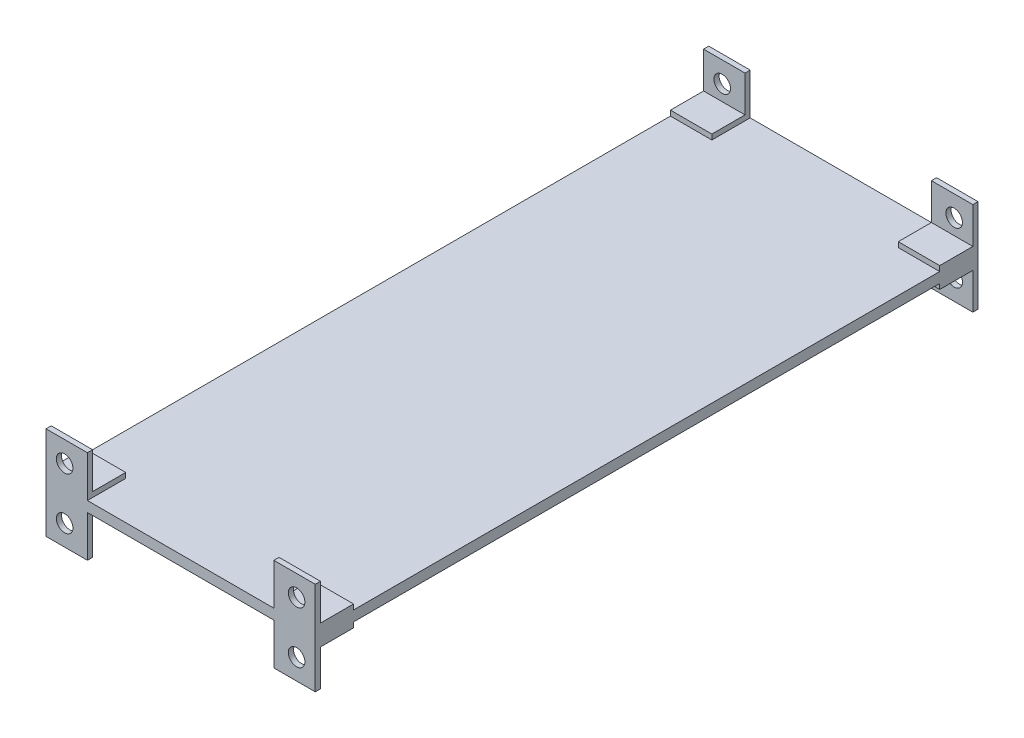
ISO-10303-21;
HEADER;
FILE_DESCRIPTION(('STEP AP214'),'2;1');
FILE_NAME('part.step','',(''),(''),'','','');
FILE_SCHEMA(('AUTOMOTIVE_DESIGN { 1 0 10303 214 1 1 1 1 }'));
ENDSEC;
DATA;
#1=APPLICATION_CONTEXT('core data for automotive mechanical design processes');
#2=APPLICATION_PROTOCOL_DEFINITION('international standard','automotive_design',2000,#1);
#3=PRODUCT_CONTEXT('',#1,'mechanical');
#4=PRODUCT('Part','Part','',(#3));
#5=PRODUCT_RELATED_PRODUCT_CATEGORY('part','',(#4));
#6=PRODUCT_DEFINITION_FORMATION('','',#4);
#7=PRODUCT_DEFINITION_CONTEXT('part definition',#1,'design');
#8=PRODUCT_DEFINITION('design','',#6,#7);
#9=PRODUCT_DEFINITION_SHAPE('','',#8);
#10=(LENGTH_UNIT() NAMED_UNIT(*) SI_UNIT(.MILLI.,.METRE.));
#11=(NAMED_UNIT(*) PLANE_ANGLE_UNIT() SI_UNIT($,.RADIAN.));
#12=(NAMED_UNIT(*) SI_UNIT($,.STERADIAN.) SOLID_ANGLE_UNIT());
#13=UNCERTAINTY_MEASURE_WITH_UNIT(LENGTH_MEASURE(1.E-05),#10,'distance_accuracy_value','');
#14=(GEOMETRIC_REPRESENTATION_CONTEXT(3) GLOBAL_UNCERTAINTY_ASSIGNED_CONTEXT((#13)) GLOBAL_UNIT_ASSIGNED_CONTEXT((#10,
#11,#12)) REPRESENTATION_CONTEXT('',''));
#15=CARTESIAN_POINT('',(0.,0.,0.));
#16=DIRECTION('',(0.,0.,1.));
#17=DIRECTION('',(1.,0.,0.));
#18=AXIS2_PLACEMENT_3D('',#15,#16,#17);
#19=CARTESIAN_POINT('',(-20.6375,0.79375,-101.6));
#20=DIRECTION('',(0.,-1.,0.));
#21=DIRECTION('',(0.,0.,-1.));
#22=AXIS2_PLACEMENT_3D('',#19,#20,#21);
#23=PLANE('',#22);
#24=DIRECTION('',(1.,0.,0.));
#25=VECTOR('',#24,1.);
#26=CARTESIAN_POINT('',(-20.6375,0.79375,-95.72625));
#27=LINE('',#26,#25);
#28=CARTESIAN_POINT('',(14.2875,0.79375,-95.72625));
#29=VERTEX_POINT('',#28);
#30=CARTESIAN_POINT('',(20.6375,0.79375,-95.72625));
#31=VERTEX_POINT('',#30);
#32=EDGE_CURVE('E362',#29,#31,#27,.T.);
#33=ORIENTED_EDGE('',*,*,#32,.F.);
#34=DIRECTION('',(0.,0.,1.));
#35=VECTOR('',#34,1.);
#36=CARTESIAN_POINT('',(14.2875,0.79375,-101.6));
#37=LINE('',#36,#35);
#38=CARTESIAN_POINT('',(14.2875,0.79375,-101.6));
#39=VERTEX_POINT('',#38);
#40=EDGE_CURVE('E48',#39,#29,#37,.T.);
#41=ORIENTED_EDGE('',*,*,#40,.F.);
#42=DIRECTION('',(-1.,0.,0.));
#43=VECTOR('',#42,1.);
#44=CARTESIAN_POINT('',(-20.6375,0.79375,-101.6));
#45=LINE('',#44,#43);
#46=CARTESIAN_POINT('',(-14.2875,0.79375,-101.6));
#47=VERTEX_POINT('',#46);
#48=EDGE_CURVE('E627',#39,#47,#45,.T.);
#49=ORIENTED_EDGE('',*,*,#48,.T.);
#50=DIRECTION('',(0.,0.,-1.));
#51=VECTOR('',#50,1.);
#52=CARTESIAN_POINT('',(-14.2875,0.79375,-101.6));
#53=LINE('',#52,#51);
#54=CARTESIAN_POINT('',(-14.2875,0.79375,-95.72625));
#55=VERTEX_POINT('',#54);
#56=EDGE_CURVE('E536',#55,#47,#53,.T.);
#57=ORIENTED_EDGE('',*,*,#56,.F.);
#58=DIRECTION('',(1.,0.,0.));
#59=VECTOR('',#58,1.);
#60=CARTESIAN_POINT('',(-20.6375,0.79375,-95.72625));
#61=LINE('',#60,#59);
#62=CARTESIAN_POINT('',(-20.6375,0.79375,-95.72625));
#63=VERTEX_POINT('',#62);
#64=EDGE_CURVE('E394',#63,#55,#61,.T.);
#65=ORIENTED_EDGE('',*,*,#64,.F.);
#66=DIRECTION('',(0.,0.,1.));
#67=VECTOR('',#66,1.);
#68=CARTESIAN_POINT('',(-20.6375,0.79375,0.));
#69=LINE('',#68,#67);
#70=CARTESIAN_POINT('',(-20.6375,0.79375,-5.87375));
#71=VERTEX_POINT('',#70);
#72=EDGE_CURVE('E622',#63,#71,#69,.T.);
#73=ORIENTED_EDGE('',*,*,#72,.T.);
#74=DIRECTION('',(-1.,0.,0.));
#75=VECTOR('',#74,1.);
#76=CARTESIAN_POINT('',(-20.6375,0.79375,-5.87375));
#77=LINE('',#76,#75);
#78=CARTESIAN_POINT('',(-14.2875,0.79375,-5.87375));
#79=VERTEX_POINT('',#78);
#80=EDGE_CURVE('E430',#79,#71,#77,.T.);
#81=ORIENTED_EDGE('',*,*,#80,.F.);
#82=DIRECTION('',(0.,0.,-1.));
#83=VECTOR('',#82,1.);
#84=CARTESIAN_POINT('',(-14.2875000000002,0.79375,-101.6));
#85=LINE('',#84,#83);
#86=CARTESIAN_POINT('',(-14.2875,0.79375,0.));
#87=VERTEX_POINT('',#86);
#88=EDGE_CURVE('E574',#87,#79,#85,.T.);
#89=ORIENTED_EDGE('',*,*,#88,.F.);
#90=DIRECTION('',(1.,0.,0.));
#91=VECTOR('',#90,1.);
#92=CARTESIAN_POINT('',(-20.6375,0.79375,0.));
#93=LINE('',#92,#91);
#94=CARTESIAN_POINT('',(14.2875,0.79375,0.));
#95=VERTEX_POINT('',#94);
#96=EDGE_CURVE('E624',#87,#95,#93,.T.);
#97=ORIENTED_EDGE('',*,*,#96,.T.);
#98=DIRECTION('',(0.,0.,1.));
#99=VECTOR('',#98,1.);
#100=CARTESIAN_POINT('',(14.2875000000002,0.79375,-101.6));
#101=LINE('',#100,#99);
#102=CARTESIAN_POINT('',(14.2875,0.79375,-5.87375));
#103=VERTEX_POINT('',#102);
#104=EDGE_CURVE('E610',#103,#95,#101,.T.);
#105=ORIENTED_EDGE('',*,*,#104,.F.);
#106=DIRECTION('',(-1.,0.,0.));
#107=VECTOR('',#106,1.);
#108=CARTESIAN_POINT('',(-20.6375,0.79375,-5.87375));
#109=LINE('',#108,#107);
#110=CARTESIAN_POINT('',(20.6375,0.79375,-5.87375));
#111=VERTEX_POINT('',#110);
#112=EDGE_CURVE('E463',#111,#103,#109,.T.);
#113=ORIENTED_EDGE('',*,*,#112,.F.);
#114=DIRECTION('',(0.,0.,-1.));
#115=VECTOR('',#114,1.);
#116=CARTESIAN_POINT('',(20.6375,0.79375,0.));
#117=LINE('',#116,#115);
#118=EDGE_CURVE('E55',#111,#31,#117,.T.);
#119=ORIENTED_EDGE('',*,*,#118,.T.);
#120=EDGE_LOOP('',(#33,#41,#49,#57,#65,#73,#81,#89,#97,#105,#113,#119));
#121=FACE_BOUND('',#120,.T.);
#122=ADVANCED_FACE('F31',(#121),#23,.F.);
#123=CARTESIAN_POINT('',(-20.6375,-0.79375,-101.6));
#124=DIRECTION('',(0.,-1.,0.));
#125=DIRECTION('',(0.,0.,-1.));
#126=AXIS2_PLACEMENT_3D('',#123,#124,#125);
#127=PLANE('',#126);
#128=DIRECTION('',(0.,0.,1.));
#129=VECTOR('',#128,1.);
#130=CARTESIAN_POINT('',(14.2875,-0.79375,-101.6));
#131=LINE('',#130,#129);
#132=CARTESIAN_POINT('',(14.2875,-0.79375,-101.6));
#133=VERTEX_POINT('',#132);
#134=CARTESIAN_POINT('',(14.2875,-0.79375,-95.72625));
#135=VERTEX_POINT('',#134);
#136=EDGE_CURVE('E496',#133,#135,#131,.T.);
#137=ORIENTED_EDGE('',*,*,#136,.T.);
#138=DIRECTION('',(1.,0.,0.));
#139=VECTOR('',#138,1.);
#140=CARTESIAN_POINT('',(-20.6375,-0.79375,-95.72625));
#141=LINE('',#140,#139);
#142=CARTESIAN_POINT('',(20.6375,-0.79375,-95.72625));
#143=VERTEX_POINT('',#142);
#144=EDGE_CURVE('E323',#135,#143,#141,.T.);
#145=ORIENTED_EDGE('',*,*,#144,.T.);
#146=DIRECTION('',(0.,0.,-1.));
#147=VECTOR('',#146,1.);
#148=CARTESIAN_POINT('',(20.6375,-0.79375,0.));
#149=LINE('',#148,#147);
#150=CARTESIAN_POINT('',(20.6375,-0.79375,-5.87375));
#151=VERTEX_POINT('',#150);
#152=EDGE_CURVE('E617',#151,#143,#149,.T.);
#153=ORIENTED_EDGE('',*,*,#152,.F.);
#154=DIRECTION('',(-1.,0.,0.));
#155=VECTOR('',#154,1.);
#156=CARTESIAN_POINT('',(-20.6375,-0.79375,-5.87375));
#157=LINE('',#156,#155);
#158=CARTESIAN_POINT('',(14.2875,-0.79375,-5.87375));
#159=VERTEX_POINT('',#158);
#160=EDGE_CURVE('E460',#151,#159,#157,.T.);
#161=ORIENTED_EDGE('',*,*,#160,.T.);
#162=DIRECTION('',(0.,0.,1.));
#163=VECTOR('',#162,1.);
#164=CARTESIAN_POINT('',(14.2875000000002,-0.79375,-101.6));
#165=LINE('',#164,#163);
#166=CARTESIAN_POINT('',(14.2875,-0.79375,0.));
#167=VERTEX_POINT('',#166);
#168=EDGE_CURVE('E11',#159,#167,#165,.T.);
#169=ORIENTED_EDGE('',*,*,#168,.T.);
#170=DIRECTION('',(1.,0.,0.));
#171=VECTOR('',#170,1.);
#172=CARTESIAN_POINT('',(-20.6375,-0.79375,0.));
#173=LINE('',#172,#171);
#174=CARTESIAN_POINT('',(-14.2875,-0.79375,0.));
#175=VERTEX_POINT('',#174);
#176=EDGE_CURVE('E615',#175,#167,#173,.T.);
#177=ORIENTED_EDGE('',*,*,#176,.F.);
#178=DIRECTION('',(0.,0.,-1.));
#179=VECTOR('',#178,1.);
#180=CARTESIAN_POINT('',(-14.2875000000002,-0.79375,-101.6));
#181=LINE('',#180,#179);
#182=CARTESIAN_POINT('',(-14.2875,-0.79375,-5.87375));
#183=VERTEX_POINT('',#182);
#184=EDGE_CURVE('E572',#175,#183,#181,.T.);
#185=ORIENTED_EDGE('',*,*,#184,.T.);
#186=DIRECTION('',(-1.,0.,0.));
#187=VECTOR('',#186,1.);
#188=CARTESIAN_POINT('',(-20.6375,-0.79375,-5.87375));
#189=LINE('',#188,#187);
#190=CARTESIAN_POINT('',(-20.6375,-0.79375,-5.87375));
#191=VERTEX_POINT('',#190);
#192=EDGE_CURVE('E427',#183,#191,#189,.T.);
#193=ORIENTED_EDGE('',*,*,#192,.T.);
#194=DIRECTION('',(0.,0.,1.));
#195=VECTOR('',#194,1.);
#196=CARTESIAN_POINT('',(-20.6375,-0.79375,0.));
#197=LINE('',#196,#195);
#198=CARTESIAN_POINT('',(-20.6375,-0.79375,-95.72625));
#199=VERTEX_POINT('',#198);
#200=EDGE_CURVE('E613',#199,#191,#197,.T.);
#201=ORIENTED_EDGE('',*,*,#200,.F.);
#202=DIRECTION('',(1.,0.,0.));
#203=VECTOR('',#202,1.);
#204=CARTESIAN_POINT('',(-20.6375,-0.79375,-95.72625));
#205=LINE('',#204,#203);
#206=CARTESIAN_POINT('',(-14.2875,-0.79375,-95.72625));
#207=VERTEX_POINT('',#206);
#208=EDGE_CURVE('E391',#199,#207,#205,.T.);
#209=ORIENTED_EDGE('',*,*,#208,.T.);
#210=DIRECTION('',(0.,0.,-1.));
#211=VECTOR('',#210,1.);
#212=CARTESIAN_POINT('',(-14.2875,-0.79375,-101.6));
#213=LINE('',#212,#211);
#214=CARTESIAN_POINT('',(-14.2875,-0.79375,-101.6));
#215=VERTEX_POINT('',#214);
#216=EDGE_CURVE('E533',#207,#215,#213,.T.);
#217=ORIENTED_EDGE('',*,*,#216,.T.);
#218=DIRECTION('',(-1.,0.,0.));
#219=VECTOR('',#218,1.);
#220=CARTESIAN_POINT('',(-20.6375,-0.79375,-101.6));
#221=LINE('',#220,#219);
#222=EDGE_CURVE('E620',#133,#215,#221,.T.);
#223=ORIENTED_EDGE('',*,*,#222,.F.);
#224=EDGE_LOOP('',(#137,#145,#153,#161,#169,#177,#185,#193,#201,#209,#217,#223));
#225=FACE_BOUND('',#224,.T.);
#226=ADVANCED_FACE('F682',(#225),#127,.T.);
#227=CARTESIAN_POINT('',(20.6375,7.14375,-100.80625));
#228=DIRECTION('',(0.,0.,-1.));
#229=DIRECTION('',(-1.,0.,0.));
#230=AXIS2_PLACEMENT_3D('',#227,#228,#229);
#231=PLANE('',#230);
#232=CARTESIAN_POINT('',(17.78,3.96875,-100.80625));
#233=DIRECTION('',(0.,0.,-1.));
#234=DIRECTION('',(-1.,0.,0.));
#235=AXIS2_PLACEMENT_3D('',#232,#233,#234);
#236=CIRCLE('',#235,1.27);
#237=CARTESIAN_POINT('',(16.51,3.96875,-100.80625));
#238=VERTEX_POINT('',#237);
#239=EDGE_CURVE('E650',#238,#238,#236,.T.);
#240=ORIENTED_EDGE('',*,*,#239,.T.);
#241=EDGE_LOOP('',(#240));
#242=FACE_BOUND('',#241,.T.);
#243=DIRECTION('',(-1.,0.,0.));
#244=VECTOR('',#243,1.);
#245=CARTESIAN_POINT('',(14.2875,1.5875,-100.80625));
#246=LINE('',#245,#244);
#247=CARTESIAN_POINT('',(20.6375,1.5875,-100.80625));
#248=VERTEX_POINT('',#247);
#249=CARTESIAN_POINT('',(14.2875,1.5875,-100.80625));
#250=VERTEX_POINT('',#249);
#251=EDGE_CURVE('E347',#248,#250,#246,.T.);
#252=ORIENTED_EDGE('',*,*,#251,.F.);
#253=DIRECTION('',(0.,-1.,0.));
#254=VECTOR('',#253,1.);
#255=CARTESIAN_POINT('',(20.6375,7.14375,-100.80625));
#256=LINE('',#255,#254);
#257=CARTESIAN_POINT('',(20.6375,7.14375,-100.80625));
#258=VERTEX_POINT('',#257);
#259=EDGE_CURVE('E493',#258,#248,#256,.T.);
#260=ORIENTED_EDGE('',*,*,#259,.F.);
#261=DIRECTION('',(1.,0.,0.));
#262=VECTOR('',#261,1.);
#263=CARTESIAN_POINT('',(20.6375,7.14375,-100.80625));
#264=LINE('',#263,#262);
#265=CARTESIAN_POINT('',(14.2875,7.14375,-100.80625));
#266=VERTEX_POINT('',#265);
#267=EDGE_CURVE('E477',#266,#258,#264,.T.);
#268=ORIENTED_EDGE('',*,*,#267,.F.);
#269=DIRECTION('',(0.,-1.,0.));
#270=VECTOR('',#269,1.);
#271=CARTESIAN_POINT('',(14.2875,7.14375,-100.80625));
#272=LINE('',#271,#270);
#273=EDGE_CURVE('E487',#266,#250,#272,.T.);
#274=ORIENTED_EDGE('',*,*,#273,.T.);
#275=EDGE_LOOP('',(#252,#260,#268,#274));
#276=FACE_BOUND('',#275,.T.);
#277=ADVANCED_FACE('F687',(#242,#276),#231,.F.);
#278=CARTESIAN_POINT('',(-20.6375,7.14375,-100.80625));
#279=DIRECTION('',(0.,0.,-1.));
#280=DIRECTION('',(-1.,0.,0.));
#281=AXIS2_PLACEMENT_3D('',#278,#279,#280);
#282=PLANE('',#281);
#283=CARTESIAN_POINT('',(-17.78,3.96875,-100.80625));
#284=DIRECTION('',(0.,0.,-1.));
#285=DIRECTION('',(-1.,0.,0.));
#286=AXIS2_PLACEMENT_3D('',#283,#284,#285);
#287=CIRCLE('',#286,1.27);
#288=CARTESIAN_POINT('',(-19.05,3.96875,-100.80625));
#289=VERTEX_POINT('',#288);
#290=EDGE_CURVE('E342',#289,#289,#287,.T.);
#291=ORIENTED_EDGE('',*,*,#290,.T.);
#292=EDGE_LOOP('',(#291));
#293=FACE_BOUND('',#292,.T.);
#294=DIRECTION('',(-1.,0.,0.));
#295=VECTOR('',#294,1.);
#296=CARTESIAN_POINT('',(-14.2875,1.5875,-100.80625));
#297=LINE('',#296,#295);
#298=CARTESIAN_POINT('',(-14.2875,1.5875,-100.80625));
#299=VERTEX_POINT('',#298);
#300=CARTESIAN_POINT('',(-20.6375,1.5875,-100.80625));
#301=VERTEX_POINT('',#300);
#302=EDGE_CURVE('E378',#299,#301,#297,.T.);
#303=ORIENTED_EDGE('',*,*,#302,.F.);
#304=DIRECTION('',(0.,-1.,0.));
#305=VECTOR('',#304,1.);
#306=CARTESIAN_POINT('',(-14.2875,7.14375,-100.80625));
#307=LINE('',#306,#305);
#308=CARTESIAN_POINT('',(-14.2875,7.14375,-100.80625));
#309=VERTEX_POINT('',#308);
#310=EDGE_CURVE('E526',#309,#299,#307,.T.);
#311=ORIENTED_EDGE('',*,*,#310,.F.);
#312=DIRECTION('',(1.,0.,0.));
#313=VECTOR('',#312,1.);
#314=CARTESIAN_POINT('',(-20.6375,7.14375,-100.80625));
#315=LINE('',#314,#313);
#316=CARTESIAN_POINT('',(-20.6375,7.14375,-100.80625));
#317=VERTEX_POINT('',#316);
#318=EDGE_CURVE('E514',#317,#309,#315,.T.);
#319=ORIENTED_EDGE('',*,*,#318,.F.);
#320=DIRECTION('',(0.,-1.,0.));
#321=VECTOR('',#320,1.);
#322=CARTESIAN_POINT('',(-20.6375,7.14375,-100.80625));
#323=LINE('',#322,#321);
#324=EDGE_CURVE('E530',#317,#301,#323,.T.);
#325=ORIENTED_EDGE('',*,*,#324,.T.);
#326=EDGE_LOOP('',(#303,#311,#319,#325));
#327=FACE_BOUND('',#326,.T.);
#328=ADVANCED_FACE('F664',(#293,#327),#282,.F.);
#329=CARTESIAN_POINT('',(-20.6375,7.14375,-0.79375));
#330=DIRECTION('',(0.,0.,1.));
#331=DIRECTION('',(1.,0.,0.));
#332=AXIS2_PLACEMENT_3D('',#329,#330,#331);
#333=PLANE('',#332);
#334=CARTESIAN_POINT('',(-17.78,3.96875,-0.793749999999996));
#335=DIRECTION('',(0.,0.,1.));
#336=DIRECTION('',(1.,0.,0.));
#337=AXIS2_PLACEMENT_3D('',#334,#335,#336);
#338=CIRCLE('',#337,1.27);
#339=CARTESIAN_POINT('',(-16.51,3.96875,-0.793749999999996));
#340=VERTEX_POINT('',#339);
#341=EDGE_CURVE('E659',#340,#340,#338,.T.);
#342=ORIENTED_EDGE('',*,*,#341,.T.);
#343=EDGE_LOOP('',(#342));
#344=FACE_BOUND('',#343,.T.);
#345=DIRECTION('',(1.,0.,0.));
#346=VECTOR('',#345,1.);
#347=CARTESIAN_POINT('',(-14.2875,1.5875,-0.793749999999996));
#348=LINE('',#347,#346);
#349=CARTESIAN_POINT('',(-20.6375,1.5875,-0.79375));
#350=VERTEX_POINT('',#349);
#351=CARTESIAN_POINT('',(-14.2875,1.5875,-0.79375));
#352=VERTEX_POINT('',#351);
#353=EDGE_CURVE('E409',#350,#352,#348,.T.);
#354=ORIENTED_EDGE('',*,*,#353,.F.);
#355=DIRECTION('',(0.,-1.,0.));
#356=VECTOR('',#355,1.);
#357=CARTESIAN_POINT('',(-20.6375,7.14375,-0.79375));
#358=LINE('',#357,#356);
#359=CARTESIAN_POINT('',(-20.6375,7.14375,-0.79375));
#360=VERTEX_POINT('',#359);
#361=EDGE_CURVE('E569',#360,#350,#358,.T.);
#362=ORIENTED_EDGE('',*,*,#361,.F.);
#363=DIRECTION('',(-1.,0.,0.));
#364=VECTOR('',#363,1.);
#365=CARTESIAN_POINT('',(-20.6375,7.14375,-0.79375));
#366=LINE('',#365,#364);
#367=CARTESIAN_POINT('',(-14.2875,7.14375,-0.79375));
#368=VERTEX_POINT('',#367);
#369=EDGE_CURVE('E551',#368,#360,#366,.T.);
#370=ORIENTED_EDGE('',*,*,#369,.F.);
#371=DIRECTION('',(0.,-1.,0.));
#372=VECTOR('',#371,1.);
#373=CARTESIAN_POINT('',(-14.2875,7.14375,-0.79375));
#374=LINE('',#373,#372);
#375=EDGE_CURVE('E562',#368,#352,#374,.T.);
#376=ORIENTED_EDGE('',*,*,#375,.T.);
#377=EDGE_LOOP('',(#354,#362,#370,#376));
#378=FACE_BOUND('',#377,.T.);
#379=ADVANCED_FACE('F896',(#344,#378),#333,.F.);
#380=CARTESIAN_POINT('',(20.6375,7.14375,-0.79375));
#381=DIRECTION('',(0.,0.,1.));
#382=DIRECTION('',(1.,0.,0.));
#383=AXIS2_PLACEMENT_3D('',#380,#381,#382);
#384=PLANE('',#383);
#385=CARTESIAN_POINT('',(17.78,3.96875,-0.793749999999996));
#386=DIRECTION('',(0.,0.,1.));
#387=DIRECTION('',(1.,0.,0.));
#388=AXIS2_PLACEMENT_3D('',#385,#386,#387);
#389=CIRCLE('',#388,1.27);
#390=CARTESIAN_POINT('',(19.05,3.96875,-0.793749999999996));
#391=VERTEX_POINT('',#390);
#392=EDGE_CURVE('E917',#391,#391,#389,.T.);
#393=ORIENTED_EDGE('',*,*,#392,.T.);
#394=EDGE_LOOP('',(#393));
#395=FACE_BOUND('',#394,.T.);
#396=DIRECTION('',(1.,0.,0.));
#397=VECTOR('',#396,1.);
#398=CARTESIAN_POINT('',(14.2875,1.5875,-0.793749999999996));
#399=LINE('',#398,#397);
#400=CARTESIAN_POINT('',(14.2875,1.5875,-0.793749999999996));
#401=VERTEX_POINT('',#400);
#402=CARTESIAN_POINT('',(20.6375,1.5875,-0.793749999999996));
#403=VERTEX_POINT('',#402);
#404=EDGE_CURVE('E447',#401,#403,#399,.T.);
#405=ORIENTED_EDGE('',*,*,#404,.F.);
#406=DIRECTION('',(0.,-1.,0.));
#407=VECTOR('',#406,1.);
#408=CARTESIAN_POINT('',(14.2875,7.14375,-0.79375));
#409=LINE('',#408,#407);
#410=CARTESIAN_POINT('',(14.2875,7.14375,-0.79375));
#411=VERTEX_POINT('',#410);
#412=EDGE_CURVE('E603',#411,#401,#409,.T.);
#413=ORIENTED_EDGE('',*,*,#412,.F.);
#414=DIRECTION('',(-1.,0.,0.));
#415=VECTOR('',#414,1.);
#416=CARTESIAN_POINT('',(20.6375,7.14375,-0.79375));
#417=LINE('',#416,#415);
#418=CARTESIAN_POINT('',(20.6375,7.14375,-0.79375));
#419=VERTEX_POINT('',#418);
#420=EDGE_CURVE('E591',#419,#411,#417,.T.);
#421=ORIENTED_EDGE('',*,*,#420,.F.);
#422=DIRECTION('',(0.,-1.,0.));
#423=VECTOR('',#422,1.);
#424=CARTESIAN_POINT('',(20.6375,7.14375,-0.79375));
#425=LINE('',#424,#423);
#426=EDGE_CURVE('E607',#419,#403,#425,.T.);
#427=ORIENTED_EDGE('',*,*,#426,.T.);
#428=EDGE_LOOP('',(#405,#413,#421,#427));
#429=FACE_BOUND('',#428,.T.);
#430=ADVANCED_FACE('F706',(#395,#429),#384,.F.);
#431=CARTESIAN_POINT('',(-20.6375,0.79375,0.));
#432=DIRECTION('',(1.,0.,0.));
#433=DIRECTION('',(0.,0.,-1.));
#434=AXIS2_PLACEMENT_3D('',#431,#432,#433);
#435=PLANE('',#434);
#436=ORIENTED_EDGE('',*,*,#72,.F.);
#437=DIRECTION('',(0.,-1.,0.));
#438=VECTOR('',#437,1.);
#439=CARTESIAN_POINT('',(-20.6375,1.5875,-95.72625));
#440=LINE('',#439,#438);
#441=CARTESIAN_POINT('',(-20.6375,1.5875,-95.72625));
#442=VERTEX_POINT('',#441);
#443=EDGE_CURVE('E389',#442,#63,#440,.T.);
#444=ORIENTED_EDGE('',*,*,#443,.F.);
#445=DIRECTION('',(0.,0.,1.));
#446=VECTOR('',#445,1.);
#447=CARTESIAN_POINT('',(-20.6375,1.5875,-100.80625));
#448=LINE('',#447,#446);
#449=EDGE_CURVE('E380',#301,#442,#448,.T.);
#450=ORIENTED_EDGE('',*,*,#449,.F.);
#451=ORIENTED_EDGE('',*,*,#324,.F.);
#452=DIRECTION('',(0.,0.,1.));
#453=VECTOR('',#452,1.);
#454=CARTESIAN_POINT('',(-20.6375,7.14375,-100.80625));
#455=LINE('',#454,#453);
#456=CARTESIAN_POINT('',(-20.6375,7.14375,-101.6));
#457=VERTEX_POINT('',#456);
#458=EDGE_CURVE('E511',#457,#317,#455,.T.);
#459=ORIENTED_EDGE('',*,*,#458,.F.);
#460=DIRECTION('',(0.,-1.,0.));
#461=VECTOR('',#460,1.);
#462=CARTESIAN_POINT('',(-20.6375,0.79375,-101.6));
#463=LINE('',#462,#461);
#464=CARTESIAN_POINT('',(-20.6375,-7.14375,-101.6));
#465=VERTEX_POINT('',#464);
#466=EDGE_CURVE('E629',#457,#465,#463,.T.);
#467=ORIENTED_EDGE('',*,*,#466,.T.);
#468=DIRECTION('',(0.,0.,1.));
#469=VECTOR('',#468,1.);
#470=CARTESIAN_POINT('',(-20.6375,-7.14375,-100.80625));
#471=LINE('',#470,#469);
#472=CARTESIAN_POINT('',(-20.6375,-7.14375,-100.80625));
#473=VERTEX_POINT('',#472);
#474=EDGE_CURVE('E499',#465,#473,#471,.T.);
#475=ORIENTED_EDGE('',*,*,#474,.T.);
#476=CARTESIAN_POINT('',(-20.6375,-1.5875,-100.80625));
#477=VERTEX_POINT('',#476);
#478=EDGE_CURVE('E529',#477,#473,#323,.T.);
#479=ORIENTED_EDGE('',*,*,#478,.F.);
#480=DIRECTION('',(0.,0.,1.));
#481=VECTOR('',#480,1.);
#482=CARTESIAN_POINT('',(-20.6375,-1.5875,-100.80625));
#483=LINE('',#482,#481);
#484=CARTESIAN_POINT('',(-20.6375,-1.5875,-95.72625));
#485=VERTEX_POINT('',#484);
#486=EDGE_CURVE('E370',#477,#485,#483,.T.);
#487=ORIENTED_EDGE('',*,*,#486,.T.);
#488=EDGE_CURVE('E388',#199,#485,#440,.T.);
#489=ORIENTED_EDGE('',*,*,#488,.F.);
#490=ORIENTED_EDGE('',*,*,#200,.T.);
#491=DIRECTION('',(0.,-1.,0.));
#492=VECTOR('',#491,1.);
#493=CARTESIAN_POINT('',(-20.6375,1.5875,-5.87375));
#494=LINE('',#493,#492);
#495=CARTESIAN_POINT('',(-20.6375,-1.5875,-5.87375));
#496=VERTEX_POINT('',#495);
#497=EDGE_CURVE('E419',#191,#496,#494,.T.);
#498=ORIENTED_EDGE('',*,*,#497,.T.);
#499=DIRECTION('',(0.,0.,1.));
#500=VECTOR('',#499,1.);
#501=CARTESIAN_POINT('',(-20.6375,-1.5875,-0.793749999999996));
#502=LINE('',#501,#500);
#503=CARTESIAN_POINT('',(-20.6375,-1.5875,-0.793749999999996));
#504=VERTEX_POINT('',#503);
#505=EDGE_CURVE('E406',#496,#504,#502,.T.);
#506=ORIENTED_EDGE('',*,*,#505,.T.);
#507=CARTESIAN_POINT('',(-20.6375,-7.14375,-0.79375));
#508=VERTEX_POINT('',#507);
#509=EDGE_CURVE('E568',#504,#508,#358,.T.);
#510=ORIENTED_EDGE('',*,*,#509,.T.);
#511=DIRECTION('',(0.,0.,1.));
#512=VECTOR('',#511,1.);
#513=CARTESIAN_POINT('',(-20.6375,-7.14375,-0.79375));
#514=LINE('',#513,#512);
#515=CARTESIAN_POINT('',(-20.6375,-7.14375,0.));
#516=VERTEX_POINT('',#515);
#517=EDGE_CURVE('E542',#508,#516,#514,.T.);
#518=ORIENTED_EDGE('',*,*,#517,.T.);
#519=DIRECTION('',(0.,-1.,0.));
#520=VECTOR('',#519,1.);
#521=CARTESIAN_POINT('',(-20.6375,0.79375,0.));
#522=LINE('',#521,#520);
#523=CARTESIAN_POINT('',(-20.6375,7.14375,0.));
#524=VERTEX_POINT('',#523);
#525=EDGE_CURVE('E40',#524,#516,#522,.T.);
#526=ORIENTED_EDGE('',*,*,#525,.F.);
#527=DIRECTION('',(0.,0.,1.));
#528=VECTOR('',#527,1.);
#529=CARTESIAN_POINT('',(-20.6375,7.14375,-0.79375));
#530=LINE('',#529,#528);
#531=EDGE_CURVE('E554',#360,#524,#530,.T.);
#532=ORIENTED_EDGE('',*,*,#531,.F.);
#533=ORIENTED_EDGE('',*,*,#361,.T.);
#534=DIRECTION('',(0.,0.,1.));
#535=VECTOR('',#534,1.);
#536=CARTESIAN_POINT('',(-20.6375,1.5875,-0.793749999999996));
#537=LINE('',#536,#535);
#538=CARTESIAN_POINT('',(-20.6375,1.5875,-5.87375));
#539=VERTEX_POINT('',#538);
#540=EDGE_CURVE('E416',#539,#350,#537,.T.);
#541=ORIENTED_EDGE('',*,*,#540,.F.);
#542=EDGE_CURVE('E420',#539,#71,#494,.T.);
#543=ORIENTED_EDGE('',*,*,#542,.T.);
#544=EDGE_LOOP('',(#436,#444,#450,#451,#459,#467,#475,#479,#487,#489,#490,#498,#506,#510,#518,
#526,#532,#533,#541,#543));
#545=FACE_BOUND('',#544,.T.);
#546=ADVANCED_FACE('F33',(#545),#435,.F.);
#547=CARTESIAN_POINT('',(-20.6375,0.79375,0.));
#548=DIRECTION('',(0.,0.,-1.));
#549=DIRECTION('',(-1.,0.,0.));
#550=AXIS2_PLACEMENT_3D('',#547,#548,#549);
#551=PLANE('',#550);
#552=CARTESIAN_POINT('',(17.78,-3.96875,0.));
#553=DIRECTION('',(0.,0.,1.));
#554=DIRECTION('',(1.,0.,0.));
#555=AXIS2_PLACEMENT_3D('',#552,#553,#554);
#556=CIRCLE('',#555,1.27);
#557=CARTESIAN_POINT('',(19.05,-3.96875,0.));
#558=VERTEX_POINT('',#557);
#559=EDGE_CURVE('E711',#558,#558,#556,.T.);
#560=ORIENTED_EDGE('',*,*,#559,.F.);
#561=EDGE_LOOP('',(#560));
#562=FACE_BOUND('',#561,.T.);
#563=CARTESIAN_POINT('',(17.78,3.96875,0.));
#564=DIRECTION('',(0.,0.,1.));
#565=DIRECTION('',(1.,0.,0.));
#566=AXIS2_PLACEMENT_3D('',#563,#564,#565);
#567=CIRCLE('',#566,1.27);
#568=CARTESIAN_POINT('',(19.05,3.96875,0.));
#569=VERTEX_POINT('',#568);
#570=EDGE_CURVE('E715',#569,#569,#567,.T.);
#571=ORIENTED_EDGE('',*,*,#570,.F.);
#572=EDGE_LOOP('',(#571));
#573=FACE_BOUND('',#572,.T.);
#574=CARTESIAN_POINT('',(-17.78,-3.96875,0.));
#575=DIRECTION('',(0.,0.,1.));
#576=DIRECTION('',(1.,0.,0.));
#577=AXIS2_PLACEMENT_3D('',#574,#575,#576);
#578=CIRCLE('',#577,1.27);
#579=CARTESIAN_POINT('',(-16.51,-3.96875,0.));
#580=VERTEX_POINT('',#579);
#581=EDGE_CURVE('E645',#580,#580,#578,.T.);
#582=ORIENTED_EDGE('',*,*,#581,.F.);
#583=EDGE_LOOP('',(#582));
#584=FACE_BOUND('',#583,.T.);
#585=CARTESIAN_POINT('',(-17.78,3.96875,0.));
#586=DIRECTION('',(0.,0.,1.));
#587=DIRECTION('',(1.,0.,0.));
#588=AXIS2_PLACEMENT_3D('',#585,#586,#587);
#589=CIRCLE('',#588,1.27);
#590=CARTESIAN_POINT('',(-16.51,3.96875,0.));
#591=VERTEX_POINT('',#590);
#592=EDGE_CURVE('E642',#591,#591,#589,.T.);
#593=ORIENTED_EDGE('',*,*,#592,.F.);
#594=EDGE_LOOP('',(#593));
#595=FACE_BOUND('',#594,.T.);
#596=ORIENTED_EDGE('',*,*,#525,.T.);
#597=DIRECTION('',(1.,0.,0.));
#598=VECTOR('',#597,1.);
#599=CARTESIAN_POINT('',(-20.6375,-7.14375,0.));
#600=LINE('',#599,#598);
#601=CARTESIAN_POINT('',(-14.2875,-7.14375,0.));
#602=VERTEX_POINT('',#601);
#603=EDGE_CURVE('E545',#516,#602,#600,.T.);
#604=ORIENTED_EDGE('',*,*,#603,.T.);
#605=DIRECTION('',(0.,-1.,0.));
#606=VECTOR('',#605,1.);
#607=CARTESIAN_POINT('',(-14.2875,7.14375,0.));
#608=LINE('',#607,#606);
#609=EDGE_CURVE('E564',#175,#602,#608,.T.);
#610=ORIENTED_EDGE('',*,*,#609,.F.);
#611=ORIENTED_EDGE('',*,*,#176,.T.);
#612=DIRECTION('',(0.,-1.,0.));
#613=VECTOR('',#612,1.);
#614=CARTESIAN_POINT('',(14.2875,7.14375,0.));
#615=LINE('',#614,#613);
#616=CARTESIAN_POINT('',(14.2875,-7.14375,0.));
#617=VERTEX_POINT('',#616);
#618=EDGE_CURVE('E598',#167,#617,#615,.T.);
#619=ORIENTED_EDGE('',*,*,#618,.T.);
#620=DIRECTION('',(1.,0.,0.));
#621=VECTOR('',#620,1.);
#622=CARTESIAN_POINT('',(20.6375,-7.14375,0.));
#623=LINE('',#622,#621);
#624=CARTESIAN_POINT('',(20.6375,-7.14375,0.));
#625=VERTEX_POINT('',#624);
#626=EDGE_CURVE('E585',#617,#625,#623,.T.);
#627=ORIENTED_EDGE('',*,*,#626,.T.);
#628=DIRECTION('',(0.,-1.,0.));
#629=VECTOR('',#628,1.);
#630=CARTESIAN_POINT('',(20.6375,0.79375,0.));
#631=LINE('',#630,#629);
#632=CARTESIAN_POINT('',(20.6375,7.14375,0.));
#633=VERTEX_POINT('',#632);
#634=EDGE_CURVE('E633',#633,#625,#631,.T.);
#635=ORIENTED_EDGE('',*,*,#634,.F.);
#636=DIRECTION('',(1.,0.,0.));
#637=VECTOR('',#636,1.);
#638=CARTESIAN_POINT('',(20.6375,7.14375,0.));
#639=LINE('',#638,#637);
#640=CARTESIAN_POINT('',(14.2875,7.14375,0.));
#641=VERTEX_POINT('',#640);
#642=EDGE_CURVE('E595',#641,#633,#639,.T.);
#643=ORIENTED_EDGE('',*,*,#642,.F.);
#644=EDGE_CURVE('E599',#641,#95,#615,.T.);
#645=ORIENTED_EDGE('',*,*,#644,.T.);
#646=ORIENTED_EDGE('',*,*,#96,.F.);
#647=CARTESIAN_POINT('',(-14.2875,7.14375,0.));
#648=VERTEX_POINT('',#647);
#649=EDGE_CURVE('E565',#648,#87,#608,.T.);
#650=ORIENTED_EDGE('',*,*,#649,.F.);
#651=DIRECTION('',(1.,0.,0.));
#652=VECTOR('',#651,1.);
#653=CARTESIAN_POINT('',(-20.6375,7.14375,0.));
#654=LINE('',#653,#652);
#655=EDGE_CURVE('E557',#524,#648,#654,.T.);
#656=ORIENTED_EDGE('',*,*,#655,.F.);
#657=EDGE_LOOP('',(#596,#604,#610,#611,#619,#627,#635,#643,#645,#646,#650,#656));
#658=FACE_BOUND('',#657,.T.);
#659=ADVANCED_FACE('F699',(#562,#573,#584,#595,#658),#551,.F.);
#660=CARTESIAN_POINT('',(20.6375,0.79375,0.));
#661=DIRECTION('',(-1.,0.,0.));
#662=DIRECTION('',(0.,0.,1.));
#663=AXIS2_PLACEMENT_3D('',#660,#661,#662);
#664=PLANE('',#663);
#665=ORIENTED_EDGE('',*,*,#152,.T.);
#666=DIRECTION('',(0.,-1.,0.));
#667=VECTOR('',#666,1.);
#668=CARTESIAN_POINT('',(20.6375,1.5875,-95.72625));
#669=LINE('',#668,#667);
#670=CARTESIAN_POINT('',(20.6375,-1.5875,-95.72625));
#671=VERTEX_POINT('',#670);
#672=EDGE_CURVE('E357',#143,#671,#669,.T.);
#673=ORIENTED_EDGE('',*,*,#672,.T.);
#674=DIRECTION('',(0.,0.,-1.));
#675=VECTOR('',#674,1.);
#676=CARTESIAN_POINT('',(20.6375,-1.5875,-100.80625));
#677=LINE('',#676,#675);
#678=CARTESIAN_POINT('',(20.6375,-1.5875,-100.80625));
#679=VERTEX_POINT('',#678);
#680=EDGE_CURVE('E334',#671,#679,#677,.T.);
#681=ORIENTED_EDGE('',*,*,#680,.T.);
#682=CARTESIAN_POINT('',(20.6375,-7.14375,-100.80625));
#683=VERTEX_POINT('',#682);
#684=EDGE_CURVE('E492',#679,#683,#256,.T.);
#685=ORIENTED_EDGE('',*,*,#684,.T.);
#686=DIRECTION('',(0.,0.,-1.));
#687=VECTOR('',#686,1.);
#688=CARTESIAN_POINT('',(20.6375,-7.14375,-100.80625));
#689=LINE('',#688,#687);
#690=CARTESIAN_POINT('',(20.6375,-7.14375,-101.6));
#691=VERTEX_POINT('',#690);
#692=EDGE_CURVE('E469',#683,#691,#689,.T.);
#693=ORIENTED_EDGE('',*,*,#692,.T.);
#694=DIRECTION('',(0.,-1.,0.));
#695=VECTOR('',#694,1.);
#696=CARTESIAN_POINT('',(20.6375,0.79375,-101.6));
#697=LINE('',#696,#695);
#698=CARTESIAN_POINT('',(20.6375,7.14375,-101.6));
#699=VERTEX_POINT('',#698);
#700=EDGE_CURVE('E631',#699,#691,#697,.T.);
#701=ORIENTED_EDGE('',*,*,#700,.F.);
#702=DIRECTION('',(0.,0.,-1.));
#703=VECTOR('',#702,1.);
#704=CARTESIAN_POINT('',(20.6375,7.14375,-100.80625));
#705=LINE('',#704,#703);
#706=EDGE_CURVE('E480',#258,#699,#705,.T.);
#707=ORIENTED_EDGE('',*,*,#706,.F.);
#708=ORIENTED_EDGE('',*,*,#259,.T.);
#709=DIRECTION('',(0.,0.,-1.));
#710=VECTOR('',#709,1.);
#711=CARTESIAN_POINT('',(20.6375,1.5875,-100.80625));
#712=LINE('',#711,#710);
#713=CARTESIAN_POINT('',(20.6375,1.5875,-95.72625));
#714=VERTEX_POINT('',#713);
#715=EDGE_CURVE('E354',#714,#248,#712,.T.);
#716=ORIENTED_EDGE('',*,*,#715,.F.);
#717=EDGE_CURVE('E327',#714,#31,#669,.T.);
#718=ORIENTED_EDGE('',*,*,#717,.T.);
#719=ORIENTED_EDGE('',*,*,#118,.F.);
#720=DIRECTION('',(0.,-1.,0.));
#721=VECTOR('',#720,1.);
#722=CARTESIAN_POINT('',(20.6375,1.5875,-5.87375));
#723=LINE('',#722,#721);
#724=CARTESIAN_POINT('',(20.6375,1.5875,-5.87375));
#725=VERTEX_POINT('',#724);
#726=EDGE_CURVE('E458',#725,#111,#723,.T.);
#727=ORIENTED_EDGE('',*,*,#726,.F.);
#728=DIRECTION('',(0.,0.,-1.));
#729=VECTOR('',#728,1.);
#730=CARTESIAN_POINT('',(20.6375,1.5875,-0.793749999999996));
#731=LINE('',#730,#729);
#732=EDGE_CURVE('E449',#403,#725,#731,.T.);
#733=ORIENTED_EDGE('',*,*,#732,.F.);
#734=ORIENTED_EDGE('',*,*,#426,.F.);
#735=DIRECTION('',(0.,0.,-1.));
#736=VECTOR('',#735,1.);
#737=CARTESIAN_POINT('',(20.6375,7.14375,-0.79375));
#738=LINE('',#737,#736);
#739=EDGE_CURVE('E588',#633,#419,#738,.T.);
#740=ORIENTED_EDGE('',*,*,#739,.F.);
#741=ORIENTED_EDGE('',*,*,#634,.T.);
#742=DIRECTION('',(0.,0.,-1.));
#743=VECTOR('',#742,1.);
#744=CARTESIAN_POINT('',(20.6375,-7.14375,-0.79375));
#745=LINE('',#744,#743);
#746=CARTESIAN_POINT('',(20.6375,-7.14375,-0.79375));
#747=VERTEX_POINT('',#746);
#748=EDGE_CURVE('E576',#625,#747,#745,.T.);
#749=ORIENTED_EDGE('',*,*,#748,.T.);
#750=CARTESIAN_POINT('',(20.6375,-1.5875,-0.79375));
#751=VERTEX_POINT('',#750);
#752=EDGE_CURVE('E606',#751,#747,#425,.T.);
#753=ORIENTED_EDGE('',*,*,#752,.F.);
#754=DIRECTION('',(0.,0.,-1.));
#755=VECTOR('',#754,1.);
#756=CARTESIAN_POINT('',(20.6375,-1.5875,-0.793749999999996));
#757=LINE('',#756,#755);
#758=CARTESIAN_POINT('',(20.6375,-1.5875,-5.87375));
#759=VERTEX_POINT('',#758);
#760=EDGE_CURVE('E439',#751,#759,#757,.T.);
#761=ORIENTED_EDGE('',*,*,#760,.T.);
#762=EDGE_CURVE('E457',#151,#759,#723,.T.);
#763=ORIENTED_EDGE('',*,*,#762,.F.);
#764=EDGE_LOOP('',(#665,#673,#681,#685,#693,#701,#707,#708,#716,#718,#719,#727,#733,#734,#740,
#741,#749,#753,#761,#763));
#765=FACE_BOUND('',#764,.T.);
#766=ADVANCED_FACE('F696',(#765),#664,.F.);
#767=CARTESIAN_POINT('',(-20.6375,0.79375,-101.6));
#768=DIRECTION('',(0.,0.,1.));
#769=DIRECTION('',(1.,0.,0.));
#770=AXIS2_PLACEMENT_3D('',#767,#768,#769);
#771=PLANE('',#770);
#772=CARTESIAN_POINT('',(17.78,-3.96875,-101.6));
#773=DIRECTION('',(0.,0.,1.));
#774=DIRECTION('',(1.,0.,0.));
#775=AXIS2_PLACEMENT_3D('',#772,#773,#774);
#776=CIRCLE('',#775,1.27);
#777=CARTESIAN_POINT('',(19.05,-3.96875,-101.6));
#778=VERTEX_POINT('',#777);
#779=EDGE_CURVE('E963',#778,#778,#776,.T.);
#780=ORIENTED_EDGE('',*,*,#779,.T.);
#781=EDGE_LOOP('',(#780));
#782=FACE_BOUND('',#781,.T.);
#783=CARTESIAN_POINT('',(17.78,3.96875,-101.6));
#784=DIRECTION('',(0.,0.,1.));
#785=DIRECTION('',(1.,0.,0.));
#786=AXIS2_PLACEMENT_3D('',#783,#784,#785);
#787=CIRCLE('',#786,1.27);
#788=CARTESIAN_POINT('',(19.05,3.96875,-101.6));
#789=VERTEX_POINT('',#788);
#790=EDGE_CURVE('E955',#789,#789,#787,.T.);
#791=ORIENTED_EDGE('',*,*,#790,.T.);
#792=EDGE_LOOP('',(#791));
#793=FACE_BOUND('',#792,.T.);
#794=CARTESIAN_POINT('',(-17.78,-3.96875,-101.6));
#795=DIRECTION('',(0.,0.,1.));
#796=DIRECTION('',(1.,0.,0.));
#797=AXIS2_PLACEMENT_3D('',#794,#795,#796);
#798=CIRCLE('',#797,1.27);
#799=CARTESIAN_POINT('',(-16.51,-3.96875,-101.6));
#800=VERTEX_POINT('',#799);
#801=EDGE_CURVE('E638',#800,#800,#798,.T.);
#802=ORIENTED_EDGE('',*,*,#801,.T.);
#803=EDGE_LOOP('',(#802));
#804=FACE_BOUND('',#803,.T.);
#805=CARTESIAN_POINT('',(-17.78,3.96875,-101.6));
#806=DIRECTION('',(0.,0.,1.));
#807=DIRECTION('',(1.,0.,0.));
#808=AXIS2_PLACEMENT_3D('',#805,#806,#807);
#809=CIRCLE('',#808,1.27);
#810=CARTESIAN_POINT('',(-16.51,3.96875,-101.6));
#811=VERTEX_POINT('',#810);
#812=EDGE_CURVE('E656',#811,#811,#809,.T.);
#813=ORIENTED_EDGE('',*,*,#812,.T.);
#814=EDGE_LOOP('',(#813));
#815=FACE_BOUND('',#814,.T.);
#816=ORIENTED_EDGE('',*,*,#700,.T.);
#817=DIRECTION('',(-1.,0.,0.));
#818=VECTOR('',#817,1.);
#819=CARTESIAN_POINT('',(20.6375,-7.14375,-101.6));
#820=LINE('',#819,#818);
#821=CARTESIAN_POINT('',(14.2875,-7.14375,-101.6));
#822=VERTEX_POINT('',#821);
#823=EDGE_CURVE('E472',#691,#822,#820,.T.);
#824=ORIENTED_EDGE('',*,*,#823,.T.);
#825=DIRECTION('',(0.,-1.,0.));
#826=VECTOR('',#825,1.);
#827=CARTESIAN_POINT('',(14.2875,7.14375,-101.6));
#828=LINE('',#827,#826);
#829=EDGE_CURVE('E489',#133,#822,#828,.T.);
#830=ORIENTED_EDGE('',*,*,#829,.F.);
#831=ORIENTED_EDGE('',*,*,#222,.T.);
#832=DIRECTION('',(0.,-1.,0.));
#833=VECTOR('',#832,1.);
#834=CARTESIAN_POINT('',(-14.2875,7.14375,-101.6));
#835=LINE('',#834,#833);
#836=CARTESIAN_POINT('',(-14.2875,-7.14375,-101.6));
#837=VERTEX_POINT('',#836);
#838=EDGE_CURVE('E521',#215,#837,#835,.T.);
#839=ORIENTED_EDGE('',*,*,#838,.T.);
#840=DIRECTION('',(-1.,0.,0.));
#841=VECTOR('',#840,1.);
#842=CARTESIAN_POINT('',(-20.6375,-7.14375,-101.6));
#843=LINE('',#842,#841);
#844=EDGE_CURVE('E508',#837,#465,#843,.T.);
#845=ORIENTED_EDGE('',*,*,#844,.T.);
#846=ORIENTED_EDGE('',*,*,#466,.F.);
#847=DIRECTION('',(-1.,0.,0.));
#848=VECTOR('',#847,1.);
#849=CARTESIAN_POINT('',(-20.6375,7.14375,-101.6));
#850=LINE('',#849,#848);
#851=CARTESIAN_POINT('',(-14.2875,7.14375,-101.6));
#852=VERTEX_POINT('',#851);
#853=EDGE_CURVE('E518',#852,#457,#850,.T.);
#854=ORIENTED_EDGE('',*,*,#853,.F.);
#855=EDGE_CURVE('E522',#852,#47,#835,.T.);
#856=ORIENTED_EDGE('',*,*,#855,.T.);
#857=ORIENTED_EDGE('',*,*,#48,.F.);
#858=CARTESIAN_POINT('',(14.2875,7.14375,-101.6));
#859=VERTEX_POINT('',#858);
#860=EDGE_CURVE('E490',#859,#39,#828,.T.);
#861=ORIENTED_EDGE('',*,*,#860,.F.);
#862=DIRECTION('',(-1.,0.,0.));
#863=VECTOR('',#862,1.);
#864=CARTESIAN_POINT('',(20.6375,7.14375,-101.6));
#865=LINE('',#864,#863);
#866=EDGE_CURVE('E483',#699,#859,#865,.T.);
#867=ORIENTED_EDGE('',*,*,#866,.F.);
#868=EDGE_LOOP('',(#816,#824,#830,#831,#839,#845,#846,#854,#856,#857,#861,#867));
#869=FACE_BOUND('',#868,.T.);
#870=ADVANCED_FACE('F692',(#782,#793,#804,#815,#869),#771,.F.);
#871=CARTESIAN_POINT('',(20.6375,-7.14375,0.));
#872=DIRECTION('',(0.,-1.,0.));
#873=DIRECTION('',(0.,0.,-1.));
#874=AXIS2_PLACEMENT_3D('',#871,#872,#873);
#875=PLANE('',#874);
#876=ORIENTED_EDGE('',*,*,#748,.F.);
#877=ORIENTED_EDGE('',*,*,#626,.F.);
#878=DIRECTION('',(0.,0.,1.));
#879=VECTOR('',#878,1.);
#880=CARTESIAN_POINT('',(14.2875,-7.14375,-0.79375));
#881=LINE('',#880,#879);
#882=CARTESIAN_POINT('',(14.2875,-7.14375,-0.79375));
#883=VERTEX_POINT('',#882);
#884=EDGE_CURVE('E582',#883,#617,#881,.T.);
#885=ORIENTED_EDGE('',*,*,#884,.F.);
#886=DIRECTION('',(-1.,0.,0.));
#887=VECTOR('',#886,1.);
#888=CARTESIAN_POINT('',(20.6375,-7.14375,-0.79375));
#889=LINE('',#888,#887);
#890=EDGE_CURVE('E579',#747,#883,#889,.T.);
#891=ORIENTED_EDGE('',*,*,#890,.F.);
#892=EDGE_LOOP('',(#876,#877,#885,#891));
#893=FACE_BOUND('',#892,.T.);
#894=ADVANCED_FACE('F695',(#893),#875,.T.);
#895=CARTESIAN_POINT('',(14.2875,7.14375,-0.79375));
#896=DIRECTION('',(1.,0.,0.));
#897=DIRECTION('',(0.,0.,-1.));
#898=AXIS2_PLACEMENT_3D('',#895,#896,#897);
#899=PLANE('',#898);
#900=ORIENTED_EDGE('',*,*,#168,.F.);
#901=DIRECTION('',(0.,-1.,0.));
#902=VECTOR('',#901,1.);
#903=CARTESIAN_POINT('',(14.2875,1.5875,-5.87375));
#904=LINE('',#903,#902);
#905=CARTESIAN_POINT('',(14.2875,-1.5875,-5.87375));
#906=VERTEX_POINT('',#905);
#907=EDGE_CURVE('E453',#159,#906,#904,.T.);
#908=ORIENTED_EDGE('',*,*,#907,.T.);
#909=DIRECTION('',(0.,0.,1.));
#910=VECTOR('',#909,1.);
#911=CARTESIAN_POINT('',(14.2875,-1.5875,-0.793749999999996));
#912=LINE('',#911,#910);
#913=CARTESIAN_POINT('',(14.2875,-1.5875,-0.793749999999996));
#914=VERTEX_POINT('',#913);
#915=EDGE_CURVE('E433',#906,#914,#912,.T.);
#916=ORIENTED_EDGE('',*,*,#915,.T.);
#917=EDGE_CURVE('E602',#914,#883,#409,.T.);
#918=ORIENTED_EDGE('',*,*,#917,.T.);
#919=ORIENTED_EDGE('',*,*,#884,.T.);
#920=ORIENTED_EDGE('',*,*,#618,.F.);
#921=EDGE_LOOP('',(#900,#908,#916,#918,#919,#920));
#922=FACE_BOUND('',#921,.T.);
#923=ADVANCED_FACE('F744',(#922),#899,.F.);
#924=CARTESIAN_POINT('',(17.78,-3.96875,-0.793749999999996));
#925=DIRECTION('',(0.,0.,1.));
#926=DIRECTION('',(1.,0.,0.));
#927=AXIS2_PLACEMENT_3D('',#924,#925,#926);
#928=CIRCLE('',#927,1.27);
#929=CARTESIAN_POINT('',(19.05,-3.96875,-0.793749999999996));
#930=VERTEX_POINT('',#929);
#931=EDGE_CURVE('E961',#930,#930,#928,.T.);
#932=ORIENTED_EDGE('',*,*,#931,.T.);
#933=EDGE_LOOP('',(#932));
#934=FACE_BOUND('',#933,.T.);
#935=ORIENTED_EDGE('',*,*,#917,.F.);
#936=DIRECTION('',(1.,0.,0.));
#937=VECTOR('',#936,1.);
#938=CARTESIAN_POINT('',(14.2875,-1.5875,-0.793749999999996));
#939=LINE('',#938,#937);
#940=EDGE_CURVE('E436',#914,#751,#939,.T.);
#941=ORIENTED_EDGE('',*,*,#940,.T.);
#942=ORIENTED_EDGE('',*,*,#752,.T.);
#943=ORIENTED_EDGE('',*,*,#890,.T.);
#944=EDGE_LOOP('',(#935,#941,#942,#943));
#945=FACE_BOUND('',#944,.T.);
#946=ADVANCED_FACE('F755',(#934,#945),#384,.F.);
#947=ORIENTED_EDGE('',*,*,#412,.T.);
#948=DIRECTION('',(0.,0.,1.));
#949=VECTOR('',#948,1.);
#950=CARTESIAN_POINT('',(14.2875,1.5875,-0.793749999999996));
#951=LINE('',#950,#949);
#952=CARTESIAN_POINT('',(14.2875,1.5875,-5.87375));
#953=VERTEX_POINT('',#952);
#954=EDGE_CURVE('E445',#953,#401,#951,.T.);
#955=ORIENTED_EDGE('',*,*,#954,.F.);
#956=EDGE_CURVE('E454',#953,#103,#904,.T.);
#957=ORIENTED_EDGE('',*,*,#956,.T.);
#958=ORIENTED_EDGE('',*,*,#104,.T.);
#959=ORIENTED_EDGE('',*,*,#644,.F.);
#960=DIRECTION('',(0.,0.,1.));
#961=VECTOR('',#960,1.);
#962=CARTESIAN_POINT('',(14.2875,7.14375,-0.79375));
#963=LINE('',#962,#961);
#964=EDGE_CURVE('E593',#411,#641,#963,.T.);
#965=ORIENTED_EDGE('',*,*,#964,.F.);
#966=EDGE_LOOP('',(#947,#955,#957,#958,#959,#965));
#967=FACE_BOUND('',#966,.T.);
#968=ADVANCED_FACE('F770',(#967),#899,.F.);
#969=CARTESIAN_POINT('',(20.6375,7.14375,0.));
#970=DIRECTION('',(0.,-1.,0.));
#971=DIRECTION('',(0.,0.,-1.));
#972=AXIS2_PLACEMENT_3D('',#969,#970,#971);
#973=PLANE('',#972);
#974=ORIENTED_EDGE('',*,*,#739,.T.);
#975=ORIENTED_EDGE('',*,*,#420,.T.);
#976=ORIENTED_EDGE('',*,*,#964,.T.);
#977=ORIENTED_EDGE('',*,*,#642,.T.);
#978=EDGE_LOOP('',(#974,#975,#976,#977));
#979=FACE_BOUND('',#978,.T.);
#980=ADVANCED_FACE('F765',(#979),#973,.F.);
#981=CARTESIAN_POINT('',(-20.6375,-7.14375,-0.79375));
#982=DIRECTION('',(0.,-1.,0.));
#983=DIRECTION('',(0.,0.,-1.));
#984=AXIS2_PLACEMENT_3D('',#981,#982,#983);
#985=PLANE('',#984);
#986=DIRECTION('',(-1.,0.,0.));
#987=VECTOR('',#986,1.);
#988=CARTESIAN_POINT('',(-20.6375,-7.14375,-0.79375));
#989=LINE('',#988,#987);
#990=CARTESIAN_POINT('',(-14.2875,-7.14375,-0.79375));
#991=VERTEX_POINT('',#990);
#992=EDGE_CURVE('E539',#991,#508,#989,.T.);
#993=ORIENTED_EDGE('',*,*,#992,.F.);
#994=DIRECTION('',(0.,0.,-1.));
#995=VECTOR('',#994,1.);
#996=CARTESIAN_POINT('',(-14.2875,-7.14375,-0.79375));
#997=LINE('',#996,#995);
#998=EDGE_CURVE('E548',#602,#991,#997,.T.);
#999=ORIENTED_EDGE('',*,*,#998,.F.);
#1000=ORIENTED_EDGE('',*,*,#603,.F.);
#1001=ORIENTED_EDGE('',*,*,#517,.F.);
#1002=EDGE_LOOP('',(#993,#999,#1000,#1001));
#1003=FACE_BOUND('',#1002,.T.);
#1004=ADVANCED_FACE('F728',(#1003),#985,.T.);
#1005=CARTESIAN_POINT('',(-14.2875,7.14375,-0.79375));
#1006=DIRECTION('',(-1.,0.,0.));
#1007=DIRECTION('',(0.,0.,1.));
#1008=AXIS2_PLACEMENT_3D('',#1005,#1006,#1007);
#1009=PLANE('',#1008);
#1010=ORIENTED_EDGE('',*,*,#184,.F.);
#1011=ORIENTED_EDGE('',*,*,#609,.T.);
#1012=ORIENTED_EDGE('',*,*,#998,.T.);
#1013=CARTESIAN_POINT('',(-14.2875,-1.5875,-0.79375));
#1014=VERTEX_POINT('',#1013);
#1015=EDGE_CURVE('E561',#1014,#991,#374,.T.);
#1016=ORIENTED_EDGE('',*,*,#1015,.F.);
#1017=DIRECTION('',(0.,0.,-1.));
#1018=VECTOR('',#1017,1.);
#1019=CARTESIAN_POINT('',(-14.2875,-1.5875,-0.793749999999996));
#1020=LINE('',#1019,#1018);
#1021=CARTESIAN_POINT('',(-14.2875,-1.5875,-5.87375));
#1022=VERTEX_POINT('',#1021);
#1023=EDGE_CURVE('E400',#1014,#1022,#1020,.T.);
#1024=ORIENTED_EDGE('',*,*,#1023,.T.);
#1025=DIRECTION('',(0.,-1.,0.));
#1026=VECTOR('',#1025,1.);
#1027=CARTESIAN_POINT('',(-14.2875,1.5875,-5.87375));
#1028=LINE('',#1027,#1026);
#1029=EDGE_CURVE('E423',#183,#1022,#1028,.T.);
#1030=ORIENTED_EDGE('',*,*,#1029,.F.);
#1031=EDGE_LOOP('',(#1010,#1011,#1012,#1016,#1024,#1030));
#1032=FACE_BOUND('',#1031,.T.);
#1033=ADVANCED_FACE('F736',(#1032),#1009,.F.);
#1034=CARTESIAN_POINT('',(-17.78,-3.96875,-0.793749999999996));
#1035=DIRECTION('',(0.,0.,1.));
#1036=DIRECTION('',(1.,0.,0.));
#1037=AXIS2_PLACEMENT_3D('',#1034,#1035,#1036);
#1038=CIRCLE('',#1037,1.27);
#1039=CARTESIAN_POINT('',(-16.51,-3.96875,-0.793749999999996));
#1040=VERTEX_POINT('',#1039);
#1041=EDGE_CURVE('E637',#1040,#1040,#1038,.T.);
#1042=ORIENTED_EDGE('',*,*,#1041,.T.);
#1043=EDGE_LOOP('',(#1042));
#1044=FACE_BOUND('',#1043,.T.);
#1045=ORIENTED_EDGE('',*,*,#509,.F.);
#1046=DIRECTION('',(1.,0.,0.));
#1047=VECTOR('',#1046,1.);
#1048=CARTESIAN_POINT('',(-14.2875,-1.5875,-0.793749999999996));
#1049=LINE('',#1048,#1047);
#1050=EDGE_CURVE('E397',#504,#1014,#1049,.T.);
#1051=ORIENTED_EDGE('',*,*,#1050,.T.);
#1052=ORIENTED_EDGE('',*,*,#1015,.T.);
#1053=ORIENTED_EDGE('',*,*,#992,.T.);
#1054=EDGE_LOOP('',(#1045,#1051,#1052,#1053));
#1055=FACE_BOUND('',#1054,.T.);
#1056=ADVANCED_FACE('F733',(#1044,#1055),#333,.F.);
#1057=ORIENTED_EDGE('',*,*,#649,.T.);
#1058=ORIENTED_EDGE('',*,*,#88,.T.);
#1059=CARTESIAN_POINT('',(-14.2875,1.5875,-5.87375));
#1060=VERTEX_POINT('',#1059);
#1061=EDGE_CURVE('E424',#1060,#79,#1028,.T.);
#1062=ORIENTED_EDGE('',*,*,#1061,.F.);
#1063=DIRECTION('',(0.,0.,-1.));
#1064=VECTOR('',#1063,1.);
#1065=CARTESIAN_POINT('',(-14.2875,1.5875,-0.793749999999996));
#1066=LINE('',#1065,#1064);
#1067=EDGE_CURVE('E412',#352,#1060,#1066,.T.);
#1068=ORIENTED_EDGE('',*,*,#1067,.F.);
#1069=ORIENTED_EDGE('',*,*,#375,.F.);
#1070=DIRECTION('',(0.,0.,-1.));
#1071=VECTOR('',#1070,1.);
#1072=CARTESIAN_POINT('',(-14.2875,7.14375,-0.79375));
#1073=LINE('',#1072,#1071);
#1074=EDGE_CURVE('E559',#648,#368,#1073,.T.);
#1075=ORIENTED_EDGE('',*,*,#1074,.F.);
#1076=EDGE_LOOP('',(#1057,#1058,#1062,#1068,#1069,#1075));
#1077=FACE_BOUND('',#1076,.T.);
#1078=ADVANCED_FACE('F774',(#1077),#1009,.F.);
#1079=CARTESIAN_POINT('',(-20.6375,7.14375,-0.79375));
#1080=DIRECTION('',(0.,-1.,0.));
#1081=DIRECTION('',(0.,0.,-1.));
#1082=AXIS2_PLACEMENT_3D('',#1079,#1080,#1081);
#1083=PLANE('',#1082);
#1084=ORIENTED_EDGE('',*,*,#369,.T.);
#1085=ORIENTED_EDGE('',*,*,#531,.T.);
#1086=ORIENTED_EDGE('',*,*,#655,.T.);
#1087=ORIENTED_EDGE('',*,*,#1074,.T.);
#1088=EDGE_LOOP('',(#1084,#1085,#1086,#1087));
#1089=FACE_BOUND('',#1088,.T.);
#1090=ADVANCED_FACE('F781',(#1089),#1083,.F.);
#1091=CARTESIAN_POINT('',(-20.6375,-7.14375,-101.6));
#1092=DIRECTION('',(0.,-1.,0.));
#1093=DIRECTION('',(0.,0.,-1.));
#1094=AXIS2_PLACEMENT_3D('',#1091,#1092,#1093);
#1095=PLANE('',#1094);
#1096=ORIENTED_EDGE('',*,*,#474,.F.);
#1097=ORIENTED_EDGE('',*,*,#844,.F.);
#1098=DIRECTION('',(0.,0.,-1.));
#1099=VECTOR('',#1098,1.);
#1100=CARTESIAN_POINT('',(-14.2875,-7.14375,-100.80625));
#1101=LINE('',#1100,#1099);
#1102=CARTESIAN_POINT('',(-14.2875,-7.14375,-100.80625));
#1103=VERTEX_POINT('',#1102);
#1104=EDGE_CURVE('E505',#1103,#837,#1101,.T.);
#1105=ORIENTED_EDGE('',*,*,#1104,.F.);
#1106=DIRECTION('',(1.,0.,0.));
#1107=VECTOR('',#1106,1.);
#1108=CARTESIAN_POINT('',(-20.6375,-7.14375,-100.80625));
#1109=LINE('',#1108,#1107);
#1110=EDGE_CURVE('E502',#473,#1103,#1109,.T.);
#1111=ORIENTED_EDGE('',*,*,#1110,.F.);
#1112=EDGE_LOOP('',(#1096,#1097,#1105,#1111));
#1113=FACE_BOUND('',#1112,.T.);
#1114=ADVANCED_FACE('F819',(#1113),#1095,.T.);
#1115=CARTESIAN_POINT('',(-14.2875,7.14375,-100.80625));
#1116=DIRECTION('',(-1.,0.,0.));
#1117=DIRECTION('',(0.,0.,1.));
#1118=AXIS2_PLACEMENT_3D('',#1115,#1116,#1117);
#1119=PLANE('',#1118);
#1120=ORIENTED_EDGE('',*,*,#216,.F.);
#1121=DIRECTION('',(0.,-1.,0.));
#1122=VECTOR('',#1121,1.);
#1123=CARTESIAN_POINT('',(-14.2875,1.5875,-95.72625));
#1124=LINE('',#1123,#1122);
#1125=CARTESIAN_POINT('',(-14.2875,-1.5875,-95.72625));
#1126=VERTEX_POINT('',#1125);
#1127=EDGE_CURVE('E384',#207,#1126,#1124,.T.);
#1128=ORIENTED_EDGE('',*,*,#1127,.T.);
#1129=DIRECTION('',(0.,0.,-1.));
#1130=VECTOR('',#1129,1.);
#1131=CARTESIAN_POINT('',(-14.2875,-1.5875,-100.80625));
#1132=LINE('',#1131,#1130);
#1133=CARTESIAN_POINT('',(-14.2875,-1.5875,-100.80625));
#1134=VERTEX_POINT('',#1133);
#1135=EDGE_CURVE('E364',#1126,#1134,#1132,.T.);
#1136=ORIENTED_EDGE('',*,*,#1135,.T.);
#1137=EDGE_CURVE('E525',#1134,#1103,#307,.T.);
#1138=ORIENTED_EDGE('',*,*,#1137,.T.);
#1139=ORIENTED_EDGE('',*,*,#1104,.T.);
#1140=ORIENTED_EDGE('',*,*,#838,.F.);
#1141=EDGE_LOOP('',(#1120,#1128,#1136,#1138,#1139,#1140));
#1142=FACE_BOUND('',#1141,.T.);
#1143=ADVANCED_FACE('F831',(#1142),#1119,.F.);
#1144=CARTESIAN_POINT('',(-17.78,-3.96875,-100.80625));
#1145=DIRECTION('',(0.,0.,-1.));
#1146=DIRECTION('',(-1.,0.,0.));
#1147=AXIS2_PLACEMENT_3D('',#1144,#1145,#1146);
#1148=CIRCLE('',#1147,1.27);
#1149=CARTESIAN_POINT('',(-19.05,-3.96875,-100.80625));
#1150=VERTEX_POINT('',#1149);
#1151=EDGE_CURVE('E635',#1150,#1150,#1148,.T.);
#1152=ORIENTED_EDGE('',*,*,#1151,.T.);
#1153=EDGE_LOOP('',(#1152));
#1154=FACE_BOUND('',#1153,.T.);
#1155=ORIENTED_EDGE('',*,*,#1137,.F.);
#1156=DIRECTION('',(-1.,0.,0.));
#1157=VECTOR('',#1156,1.);
#1158=CARTESIAN_POINT('',(-14.2875,-1.5875,-100.80625));
#1159=LINE('',#1158,#1157);
#1160=EDGE_CURVE('E367',#1134,#477,#1159,.T.);
#1161=ORIENTED_EDGE('',*,*,#1160,.T.);
#1162=ORIENTED_EDGE('',*,*,#478,.T.);
#1163=ORIENTED_EDGE('',*,*,#1110,.T.);
#1164=EDGE_LOOP('',(#1155,#1161,#1162,#1163));
#1165=FACE_BOUND('',#1164,.T.);
#1166=ADVANCED_FACE('F826',(#1154,#1165),#282,.F.);
#1167=ORIENTED_EDGE('',*,*,#310,.T.);
#1168=DIRECTION('',(0.,0.,-1.));
#1169=VECTOR('',#1168,1.);
#1170=CARTESIAN_POINT('',(-14.2875,1.5875,-100.80625));
#1171=LINE('',#1170,#1169);
#1172=CARTESIAN_POINT('',(-14.2875,1.5875,-95.72625));
#1173=VERTEX_POINT('',#1172);
#1174=EDGE_CURVE('E376',#1173,#299,#1171,.T.);
#1175=ORIENTED_EDGE('',*,*,#1174,.F.);
#1176=EDGE_CURVE('E385',#1173,#55,#1124,.T.);
#1177=ORIENTED_EDGE('',*,*,#1176,.T.);
#1178=ORIENTED_EDGE('',*,*,#56,.T.);
#1179=ORIENTED_EDGE('',*,*,#855,.F.);
#1180=DIRECTION('',(0.,0.,-1.));
#1181=VECTOR('',#1180,1.);
#1182=CARTESIAN_POINT('',(-14.2875,7.14375,-100.80625));
#1183=LINE('',#1182,#1181);
#1184=EDGE_CURVE('E516',#309,#852,#1183,.T.);
#1185=ORIENTED_EDGE('',*,*,#1184,.F.);
#1186=EDGE_LOOP('',(#1167,#1175,#1177,#1178,#1179,#1185));
#1187=FACE_BOUND('',#1186,.T.);
#1188=ADVANCED_FACE('F800',(#1187),#1119,.F.);
#1189=CARTESIAN_POINT('',(-20.6375,7.14375,-101.6));
#1190=DIRECTION('',(0.,-1.,0.));
#1191=DIRECTION('',(0.,0.,-1.));
#1192=AXIS2_PLACEMENT_3D('',#1189,#1190,#1191);
#1193=PLANE('',#1192);
#1194=ORIENTED_EDGE('',*,*,#458,.T.);
#1195=ORIENTED_EDGE('',*,*,#318,.T.);
#1196=ORIENTED_EDGE('',*,*,#1184,.T.);
#1197=ORIENTED_EDGE('',*,*,#853,.T.);
#1198=EDGE_LOOP('',(#1194,#1195,#1196,#1197));
#1199=FACE_BOUND('',#1198,.T.);
#1200=ADVANCED_FACE('F811',(#1199),#1193,.F.);
#1201=CARTESIAN_POINT('',(20.6375,-7.14375,-100.80625));
#1202=DIRECTION('',(0.,-1.,0.));
#1203=DIRECTION('',(0.,0.,-1.));
#1204=AXIS2_PLACEMENT_3D('',#1201,#1202,#1203);
#1205=PLANE('',#1204);
#1206=DIRECTION('',(1.,0.,0.));
#1207=VECTOR('',#1206,1.);
#1208=CARTESIAN_POINT('',(20.6375,-7.14375,-100.80625));
#1209=LINE('',#1208,#1207);
#1210=CARTESIAN_POINT('',(14.2875,-7.14375,-100.80625));
#1211=VERTEX_POINT('',#1210);
#1212=EDGE_CURVE('E466',#1211,#683,#1209,.T.);
#1213=ORIENTED_EDGE('',*,*,#1212,.F.);
#1214=DIRECTION('',(0.,0.,1.));
#1215=VECTOR('',#1214,1.);
#1216=CARTESIAN_POINT('',(14.2875,-7.14375,-100.80625));
#1217=LINE('',#1216,#1215);
#1218=EDGE_CURVE('E475',#822,#1211,#1217,.T.);
#1219=ORIENTED_EDGE('',*,*,#1218,.F.);
#1220=ORIENTED_EDGE('',*,*,#823,.F.);
#1221=ORIENTED_EDGE('',*,*,#692,.F.);
#1222=EDGE_LOOP('',(#1213,#1219,#1220,#1221));
#1223=FACE_BOUND('',#1222,.T.);
#1224=ADVANCED_FACE('F865',(#1223),#1205,.T.);
#1225=CARTESIAN_POINT('',(14.2875,7.14375,-100.80625));
#1226=DIRECTION('',(1.,0.,0.));
#1227=DIRECTION('',(0.,0.,-1.));
#1228=AXIS2_PLACEMENT_3D('',#1225,#1226,#1227);
#1229=PLANE('',#1228);
#1230=ORIENTED_EDGE('',*,*,#136,.F.);
#1231=ORIENTED_EDGE('',*,*,#829,.T.);
#1232=ORIENTED_EDGE('',*,*,#1218,.T.);
#1233=CARTESIAN_POINT('',(14.2875,-1.5875,-100.80625));
#1234=VERTEX_POINT('',#1233);
#1235=EDGE_CURVE('E339',#1234,#1211,#272,.T.);
#1236=ORIENTED_EDGE('',*,*,#1235,.F.);
#1237=DIRECTION('',(0.,0.,1.));
#1238=VECTOR('',#1237,1.);
#1239=CARTESIAN_POINT('',(14.2875,-1.5875,-100.80625));
#1240=LINE('',#1239,#1238);
#1241=CARTESIAN_POINT('',(14.2875,-1.5875,-95.72625));
#1242=VERTEX_POINT('',#1241);
#1243=EDGE_CURVE('E331',#1234,#1242,#1240,.T.);
#1244=ORIENTED_EDGE('',*,*,#1243,.T.);
#1245=DIRECTION('',(0.,-1.,0.));
#1246=VECTOR('',#1245,1.);
#1247=CARTESIAN_POINT('',(14.2875,1.5875,-95.72625));
#1248=LINE('',#1247,#1246);
#1249=EDGE_CURVE('E317',#135,#1242,#1248,.T.);
#1250=ORIENTED_EDGE('',*,*,#1249,.F.);
#1251=EDGE_LOOP('',(#1230,#1231,#1232,#1236,#1244,#1250));
#1252=FACE_BOUND('',#1251,.T.);
#1253=ADVANCED_FACE('F337',(#1252),#1229,.F.);
#1254=CARTESIAN_POINT('',(17.78,-3.96875,-100.80625));
#1255=DIRECTION('',(0.,0.,-1.));
#1256=DIRECTION('',(-1.,0.,0.));
#1257=AXIS2_PLACEMENT_3D('',#1254,#1255,#1256);
#1258=CIRCLE('',#1257,1.27);
#1259=CARTESIAN_POINT('',(16.51,-3.96875,-100.80625));
#1260=VERTEX_POINT('',#1259);
#1261=EDGE_CURVE('E35',#1260,#1260,#1258,.T.);
#1262=ORIENTED_EDGE('',*,*,#1261,.T.);
#1263=EDGE_LOOP('',(#1262));
#1264=FACE_BOUND('',#1263,.T.);
#1265=ORIENTED_EDGE('',*,*,#684,.F.);
#1266=DIRECTION('',(-1.,0.,0.));
#1267=VECTOR('',#1266,1.);
#1268=CARTESIAN_POINT('',(14.2875,-1.5875,-100.80625));
#1269=LINE('',#1268,#1267);
#1270=EDGE_CURVE('E340',#679,#1234,#1269,.T.);
#1271=ORIENTED_EDGE('',*,*,#1270,.T.);
#1272=ORIENTED_EDGE('',*,*,#1235,.T.);
#1273=ORIENTED_EDGE('',*,*,#1212,.T.);
#1274=EDGE_LOOP('',(#1265,#1271,#1272,#1273));
#1275=FACE_BOUND('',#1274,.T.);
#1276=ADVANCED_FACE('F875',(#1264,#1275),#231,.F.);
#1277=ORIENTED_EDGE('',*,*,#860,.T.);
#1278=ORIENTED_EDGE('',*,*,#40,.T.);
#1279=CARTESIAN_POINT('',(14.2875,1.5875,-95.72625));
#1280=VERTEX_POINT('',#1279);
#1281=EDGE_CURVE('E326',#1280,#29,#1248,.T.);
#1282=ORIENTED_EDGE('',*,*,#1281,.F.);
#1283=DIRECTION('',(0.,0.,1.));
#1284=VECTOR('',#1283,1.);
#1285=CARTESIAN_POINT('',(14.2875,1.5875,-100.80625));
#1286=LINE('',#1285,#1284);
#1287=EDGE_CURVE('E350',#250,#1280,#1286,.T.);
#1288=ORIENTED_EDGE('',*,*,#1287,.F.);
#1289=ORIENTED_EDGE('',*,*,#273,.F.);
#1290=DIRECTION('',(0.,0.,1.));
#1291=VECTOR('',#1290,1.);
#1292=CARTESIAN_POINT('',(14.2875,7.14375,-100.80625));
#1293=LINE('',#1292,#1291);
#1294=EDGE_CURVE('E485',#859,#266,#1293,.T.);
#1295=ORIENTED_EDGE('',*,*,#1294,.F.);
#1296=EDGE_LOOP('',(#1277,#1278,#1282,#1288,#1289,#1295));
#1297=FACE_BOUND('',#1296,.T.);
#1298=ADVANCED_FACE('F871',(#1297),#1229,.F.);
#1299=CARTESIAN_POINT('',(20.6375,7.14375,-100.80625));
#1300=DIRECTION('',(0.,-1.,0.));
#1301=DIRECTION('',(0.,0.,-1.));
#1302=AXIS2_PLACEMENT_3D('',#1299,#1300,#1301);
#1303=PLANE('',#1302);
#1304=ORIENTED_EDGE('',*,*,#267,.T.);
#1305=ORIENTED_EDGE('',*,*,#706,.T.);
#1306=ORIENTED_EDGE('',*,*,#866,.T.);
#1307=ORIENTED_EDGE('',*,*,#1294,.T.);
#1308=EDGE_LOOP('',(#1304,#1305,#1306,#1307));
#1309=FACE_BOUND('',#1308,.T.);
#1310=ADVANCED_FACE('F861',(#1309),#1303,.F.);
#1311=CARTESIAN_POINT('',(14.2875,1.5875,-0.793749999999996));
#1312=DIRECTION('',(0.,-1.,0.));
#1313=DIRECTION('',(0.,0.,-1.));
#1314=AXIS2_PLACEMENT_3D('',#1311,#1312,#1313);
#1315=PLANE('',#1314);
#1316=ORIENTED_EDGE('',*,*,#954,.T.);
#1317=ORIENTED_EDGE('',*,*,#404,.T.);
#1318=ORIENTED_EDGE('',*,*,#732,.T.);
#1319=DIRECTION('',(-1.,0.,0.));
#1320=VECTOR('',#1319,1.);
#1321=CARTESIAN_POINT('',(14.2875,1.5875,-5.87375));
#1322=LINE('',#1321,#1320);
#1323=EDGE_CURVE('E451',#725,#953,#1322,.T.);
#1324=ORIENTED_EDGE('',*,*,#1323,.T.);
#1325=EDGE_LOOP('',(#1316,#1317,#1318,#1324));
#1326=FACE_BOUND('',#1325,.T.);
#1327=ADVANCED_FACE('F857',(#1326),#1315,.F.);
#1328=CARTESIAN_POINT('',(14.2875,1.5875,-5.87375));
#1329=DIRECTION('',(0.,0.,1.));
#1330=DIRECTION('',(1.,0.,0.));
#1331=AXIS2_PLACEMENT_3D('',#1328,#1329,#1330);
#1332=PLANE('',#1331);
#1333=ORIENTED_EDGE('',*,*,#726,.T.);
#1334=ORIENTED_EDGE('',*,*,#112,.T.);
#1335=ORIENTED_EDGE('',*,*,#956,.F.);
#1336=ORIENTED_EDGE('',*,*,#1323,.F.);
#1337=EDGE_LOOP('',(#1333,#1334,#1335,#1336));
#1338=FACE_BOUND('',#1337,.T.);
#1339=ADVANCED_FACE('F860',(#1338),#1332,.F.);
#1340=ORIENTED_EDGE('',*,*,#160,.F.);
#1341=ORIENTED_EDGE('',*,*,#762,.T.);
#1342=DIRECTION('',(-1.,0.,0.));
#1343=VECTOR('',#1342,1.);
#1344=CARTESIAN_POINT('',(14.2875,-1.5875,-5.87375));
#1345=LINE('',#1344,#1343);
#1346=EDGE_CURVE('E442',#759,#906,#1345,.T.);
#1347=ORIENTED_EDGE('',*,*,#1346,.T.);
#1348=ORIENTED_EDGE('',*,*,#907,.F.);
#1349=EDGE_LOOP('',(#1340,#1341,#1347,#1348));
#1350=FACE_BOUND('',#1349,.T.);
#1351=ADVANCED_FACE('F747',(#1350),#1332,.F.);
#1352=CARTESIAN_POINT('',(14.2875,-1.5875,-0.793749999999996));
#1353=DIRECTION('',(0.,-1.,0.));
#1354=DIRECTION('',(0.,0.,-1.));
#1355=AXIS2_PLACEMENT_3D('',#1352,#1353,#1354);
#1356=PLANE('',#1355);
#1357=ORIENTED_EDGE('',*,*,#915,.F.);
#1358=ORIENTED_EDGE('',*,*,#1346,.F.);
#1359=ORIENTED_EDGE('',*,*,#760,.F.);
#1360=ORIENTED_EDGE('',*,*,#940,.F.);
#1361=EDGE_LOOP('',(#1357,#1358,#1359,#1360));
#1362=FACE_BOUND('',#1361,.T.);
#1363=ADVANCED_FACE('F751',(#1362),#1356,.T.);
#1364=CARTESIAN_POINT('',(-20.6375,1.5875,-0.793749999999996));
#1365=DIRECTION('',(0.,-1.,0.));
#1366=DIRECTION('',(0.,0.,-1.));
#1367=AXIS2_PLACEMENT_3D('',#1364,#1365,#1366);
#1368=PLANE('',#1367);
#1369=ORIENTED_EDGE('',*,*,#353,.T.);
#1370=ORIENTED_EDGE('',*,*,#1067,.T.);
#1371=DIRECTION('',(-1.,0.,0.));
#1372=VECTOR('',#1371,1.);
#1373=CARTESIAN_POINT('',(-14.2875,1.5875,-5.87375));
#1374=LINE('',#1373,#1372);
#1375=EDGE_CURVE('E414',#1060,#539,#1374,.T.);
#1376=ORIENTED_EDGE('',*,*,#1375,.T.);
#1377=ORIENTED_EDGE('',*,*,#540,.T.);
#1378=EDGE_LOOP('',(#1369,#1370,#1376,#1377));
#1379=FACE_BOUND('',#1378,.T.);
#1380=ADVANCED_FACE('F786',(#1379),#1368,.F.);
#1381=CARTESIAN_POINT('',(-14.2875,1.5875,-5.87375));
#1382=DIRECTION('',(0.,0.,1.));
#1383=DIRECTION('',(1.,0.,0.));
#1384=AXIS2_PLACEMENT_3D('',#1381,#1382,#1383);
#1385=PLANE('',#1384);
#1386=ORIENTED_EDGE('',*,*,#1061,.T.);
#1387=ORIENTED_EDGE('',*,*,#80,.T.);
#1388=ORIENTED_EDGE('',*,*,#542,.F.);
#1389=ORIENTED_EDGE('',*,*,#1375,.F.);
#1390=EDGE_LOOP('',(#1386,#1387,#1388,#1389));
#1391=FACE_BOUND('',#1390,.T.);
#1392=ADVANCED_FACE('F790',(#1391),#1385,.F.);
#1393=ORIENTED_EDGE('',*,*,#192,.F.);
#1394=ORIENTED_EDGE('',*,*,#1029,.T.);
#1395=DIRECTION('',(-1.,0.,0.));
#1396=VECTOR('',#1395,1.);
#1397=CARTESIAN_POINT('',(-14.2875,-1.5875,-5.87375));
#1398=LINE('',#1397,#1396);
#1399=EDGE_CURVE('E403',#1022,#496,#1398,.T.);
#1400=ORIENTED_EDGE('',*,*,#1399,.T.);
#1401=ORIENTED_EDGE('',*,*,#497,.F.);
#1402=EDGE_LOOP('',(#1393,#1394,#1400,#1401));
#1403=FACE_BOUND('',#1402,.T.);
#1404=ADVANCED_FACE('F839',(#1403),#1385,.F.);
#1405=CARTESIAN_POINT('',(-20.6375,-1.5875,-0.793749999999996));
#1406=DIRECTION('',(0.,-1.,0.));
#1407=DIRECTION('',(0.,0.,-1.));
#1408=AXIS2_PLACEMENT_3D('',#1405,#1406,#1407);
#1409=PLANE('',#1408);
#1410=ORIENTED_EDGE('',*,*,#1050,.F.);
#1411=ORIENTED_EDGE('',*,*,#505,.F.);
#1412=ORIENTED_EDGE('',*,*,#1399,.F.);
#1413=ORIENTED_EDGE('',*,*,#1023,.F.);
#1414=EDGE_LOOP('',(#1410,#1411,#1412,#1413));
#1415=FACE_BOUND('',#1414,.T.);
#1416=ADVANCED_FACE('F842',(#1415),#1409,.T.);
#1417=CARTESIAN_POINT('',(-14.2875,1.5875,-95.72625));
#1418=DIRECTION('',(0.,-1.,0.));
#1419=DIRECTION('',(0.,0.,-1.));
#1420=AXIS2_PLACEMENT_3D('',#1417,#1418,#1419);
#1421=PLANE('',#1420);
#1422=ORIENTED_EDGE('',*,*,#1174,.T.);
#1423=ORIENTED_EDGE('',*,*,#302,.T.);
#1424=ORIENTED_EDGE('',*,*,#449,.T.);
#1425=DIRECTION('',(1.,0.,0.));
#1426=VECTOR('',#1425,1.);
#1427=CARTESIAN_POINT('',(-14.2875,1.5875,-95.72625));
#1428=LINE('',#1427,#1426);
#1429=EDGE_CURVE('E382',#442,#1173,#1428,.T.);
#1430=ORIENTED_EDGE('',*,*,#1429,.T.);
#1431=EDGE_LOOP('',(#1422,#1423,#1424,#1430));
#1432=FACE_BOUND('',#1431,.T.);
#1433=ADVANCED_FACE('F806',(#1432),#1421,.F.);
#1434=CARTESIAN_POINT('',(-14.2875,1.5875,-95.72625));
#1435=DIRECTION('',(0.,0.,-1.));
#1436=DIRECTION('',(-1.,0.,0.));
#1437=AXIS2_PLACEMENT_3D('',#1434,#1435,#1436);
#1438=PLANE('',#1437);
#1439=ORIENTED_EDGE('',*,*,#443,.T.);
#1440=ORIENTED_EDGE('',*,*,#64,.T.);
#1441=ORIENTED_EDGE('',*,*,#1176,.F.);
#1442=ORIENTED_EDGE('',*,*,#1429,.F.);
#1443=EDGE_LOOP('',(#1439,#1440,#1441,#1442));
#1444=FACE_BOUND('',#1443,.T.);
#1445=ADVANCED_FACE('F797',(#1444),#1438,.F.);
#1446=ORIENTED_EDGE('',*,*,#208,.F.);
#1447=ORIENTED_EDGE('',*,*,#488,.T.);
#1448=DIRECTION('',(1.,0.,0.));
#1449=VECTOR('',#1448,1.);
#1450=CARTESIAN_POINT('',(-14.2875,-1.5875,-95.72625));
#1451=LINE('',#1450,#1449);
#1452=EDGE_CURVE('E373',#485,#1126,#1451,.T.);
#1453=ORIENTED_EDGE('',*,*,#1452,.T.);
#1454=ORIENTED_EDGE('',*,*,#1127,.F.);
#1455=EDGE_LOOP('',(#1446,#1447,#1453,#1454));
#1456=FACE_BOUND('',#1455,.T.);
#1457=ADVANCED_FACE('F834',(#1456),#1438,.F.);
#1458=CARTESIAN_POINT('',(-14.2875,-1.5875,-95.72625));
#1459=DIRECTION('',(0.,-1.,0.));
#1460=DIRECTION('',(0.,0.,-1.));
#1461=AXIS2_PLACEMENT_3D('',#1458,#1459,#1460);
#1462=PLANE('',#1461);
#1463=ORIENTED_EDGE('',*,*,#1135,.F.);
#1464=ORIENTED_EDGE('',*,*,#1452,.F.);
#1465=ORIENTED_EDGE('',*,*,#486,.F.);
#1466=ORIENTED_EDGE('',*,*,#1160,.F.);
#1467=EDGE_LOOP('',(#1463,#1464,#1465,#1466));
#1468=FACE_BOUND('',#1467,.T.);
#1469=ADVANCED_FACE('F829',(#1468),#1462,.T.);
#1470=CARTESIAN_POINT('',(20.6375,1.5875,-100.80625));
#1471=DIRECTION('',(0.,-1.,0.));
#1472=DIRECTION('',(0.,0.,-1.));
#1473=AXIS2_PLACEMENT_3D('',#1470,#1471,#1472);
#1474=PLANE('',#1473);
#1475=ORIENTED_EDGE('',*,*,#251,.T.);
#1476=ORIENTED_EDGE('',*,*,#1287,.T.);
#1477=DIRECTION('',(1.,0.,0.));
#1478=VECTOR('',#1477,1.);
#1479=CARTESIAN_POINT('',(14.2875,1.5875,-95.72625));
#1480=LINE('',#1479,#1478);
#1481=EDGE_CURVE('E352',#1280,#714,#1480,.T.);
#1482=ORIENTED_EDGE('',*,*,#1481,.T.);
#1483=ORIENTED_EDGE('',*,*,#715,.T.);
#1484=EDGE_LOOP('',(#1475,#1476,#1482,#1483));
#1485=FACE_BOUND('',#1484,.T.);
#1486=ADVANCED_FACE('F946',(#1485),#1474,.F.);
#1487=CARTESIAN_POINT('',(14.2875,1.5875,-95.72625));
#1488=DIRECTION('',(0.,0.,-1.));
#1489=DIRECTION('',(-1.,0.,0.));
#1490=AXIS2_PLACEMENT_3D('',#1487,#1488,#1489);
#1491=PLANE('',#1490);
#1492=ORIENTED_EDGE('',*,*,#1281,.T.);
#1493=ORIENTED_EDGE('',*,*,#32,.T.);
#1494=ORIENTED_EDGE('',*,*,#717,.F.);
#1495=ORIENTED_EDGE('',*,*,#1481,.F.);
#1496=EDGE_LOOP('',(#1492,#1493,#1494,#1495));
#1497=FACE_BOUND('',#1496,.T.);
#1498=ADVANCED_FACE('F929',(#1497),#1491,.F.);
#1499=ORIENTED_EDGE('',*,*,#144,.F.);
#1500=ORIENTED_EDGE('',*,*,#1249,.T.);
#1501=DIRECTION('',(1.,0.,0.));
#1502=VECTOR('',#1501,1.);
#1503=CARTESIAN_POINT('',(14.2875,-1.5875,-95.72625));
#1504=LINE('',#1503,#1502);
#1505=EDGE_CURVE('E320',#1242,#671,#1504,.T.);
#1506=ORIENTED_EDGE('',*,*,#1505,.T.);
#1507=ORIENTED_EDGE('',*,*,#672,.F.);
#1508=EDGE_LOOP('',(#1499,#1500,#1506,#1507));
#1509=FACE_BOUND('',#1508,.T.);
#1510=ADVANCED_FACE('F319',(#1509),#1491,.F.);
#1511=CARTESIAN_POINT('',(20.6375,-1.5875,-100.80625));
#1512=DIRECTION('',(0.,-1.,0.));
#1513=DIRECTION('',(0.,0.,-1.));
#1514=AXIS2_PLACEMENT_3D('',#1511,#1512,#1513);
#1515=PLANE('',#1514);
#1516=ORIENTED_EDGE('',*,*,#1270,.F.);
#1517=ORIENTED_EDGE('',*,*,#680,.F.);
#1518=ORIENTED_EDGE('',*,*,#1505,.F.);
#1519=ORIENTED_EDGE('',*,*,#1243,.F.);
#1520=EDGE_LOOP('',(#1516,#1517,#1518,#1519));
#1521=FACE_BOUND('',#1520,.T.);
#1522=ADVANCED_FACE('F330',(#1521),#1515,.T.);
#1523=CARTESIAN_POINT('',(-17.78,3.96875,-101.6));
#1524=DIRECTION('',(0.,0.,1.));
#1525=DIRECTION('',(1.,0.,0.));
#1526=AXIS2_PLACEMENT_3D('',#1523,#1524,#1525);
#1527=CYLINDRICAL_SURFACE('',#1526,1.27);
#1528=ORIENTED_EDGE('',*,*,#812,.F.);
#1529=EDGE_LOOP('',(#1528));
#1530=FACE_BOUND('',#1529,.T.);
#1531=ORIENTED_EDGE('',*,*,#290,.F.);
#1532=EDGE_LOOP('',(#1531));
#1533=FACE_BOUND('',#1532,.T.);
#1534=ADVANCED_FACE('F667',(#1530,#1533),#1527,.F.);
#1535=ORIENTED_EDGE('',*,*,#592,.T.);
#1536=EDGE_LOOP('',(#1535));
#1537=FACE_BOUND('',#1536,.T.);
#1538=ORIENTED_EDGE('',*,*,#341,.F.);
#1539=EDGE_LOOP('',(#1538));
#1540=FACE_BOUND('',#1539,.T.);
#1541=ADVANCED_FACE('F669',(#1537,#1540),#1527,.F.);
#1542=CARTESIAN_POINT('',(-17.78,-3.96875,-101.6));
#1543=DIRECTION('',(0.,0.,1.));
#1544=DIRECTION('',(1.,0.,0.));
#1545=AXIS2_PLACEMENT_3D('',#1542,#1543,#1544);
#1546=CYLINDRICAL_SURFACE('',#1545,1.27);
#1547=ORIENTED_EDGE('',*,*,#801,.F.);
#1548=EDGE_LOOP('',(#1547));
#1549=FACE_BOUND('',#1548,.T.);
#1550=ORIENTED_EDGE('',*,*,#1151,.F.);
#1551=EDGE_LOOP('',(#1550));
#1552=FACE_BOUND('',#1551,.T.);
#1553=ADVANCED_FACE('F676',(#1549,#1552),#1546,.F.);
#1554=ORIENTED_EDGE('',*,*,#581,.T.);
#1555=EDGE_LOOP('',(#1554));
#1556=FACE_BOUND('',#1555,.T.);
#1557=ORIENTED_EDGE('',*,*,#1041,.F.);
#1558=EDGE_LOOP('',(#1557));
#1559=FACE_BOUND('',#1558,.T.);
#1560=ADVANCED_FACE('F981',(#1556,#1559),#1546,.F.);
#1561=CARTESIAN_POINT('',(17.78,3.96875,-101.6));
#1562=DIRECTION('',(0.,0.,1.));
#1563=DIRECTION('',(1.,0.,0.));
#1564=AXIS2_PLACEMENT_3D('',#1561,#1562,#1563);
#1565=CYLINDRICAL_SURFACE('',#1564,1.27);
#1566=ORIENTED_EDGE('',*,*,#790,.F.);
#1567=EDGE_LOOP('',(#1566));
#1568=FACE_BOUND('',#1567,.T.);
#1569=ORIENTED_EDGE('',*,*,#239,.F.);
#1570=EDGE_LOOP('',(#1569));
#1571=FACE_BOUND('',#1570,.T.);
#1572=ADVANCED_FACE('F979',(#1568,#1571),#1565,.F.);
#1573=ORIENTED_EDGE('',*,*,#570,.T.);
#1574=EDGE_LOOP('',(#1573));
#1575=FACE_BOUND('',#1574,.T.);
#1576=ORIENTED_EDGE('',*,*,#392,.F.);
#1577=EDGE_LOOP('',(#1576));
#1578=FACE_BOUND('',#1577,.T.);
#1579=ADVANCED_FACE('F976',(#1575,#1578),#1565,.F.);
#1580=CARTESIAN_POINT('',(17.78,-3.96875,-101.6));
#1581=DIRECTION('',(0.,0.,1.));
#1582=DIRECTION('',(1.,0.,0.));
#1583=AXIS2_PLACEMENT_3D('',#1580,#1581,#1582);
#1584=CYLINDRICAL_SURFACE('',#1583,1.27);
#1585=ORIENTED_EDGE('',*,*,#779,.F.);
#1586=EDGE_LOOP('',(#1585));
#1587=FACE_BOUND('',#1586,.T.);
#1588=ORIENTED_EDGE('',*,*,#1261,.F.);
#1589=EDGE_LOOP('',(#1588));
#1590=FACE_BOUND('',#1589,.T.);
#1591=ADVANCED_FACE('F970',(#1587,#1590),#1584,.F.);
#1592=ORIENTED_EDGE('',*,*,#559,.T.);
#1593=EDGE_LOOP('',(#1592));
#1594=FACE_BOUND('',#1593,.T.);
#1595=ORIENTED_EDGE('',*,*,#931,.F.);
#1596=EDGE_LOOP('',(#1595));
#1597=FACE_BOUND('',#1596,.T.);
#1598=ADVANCED_FACE('F967',(#1594,#1597),#1584,.F.);
#1599=CLOSED_SHELL('',(#122,#226,#277,#328,#379,#430,#546,#659,#766,#870,#894,#923,#946,#968,
#980,#1004,#1033,#1056,#1078,#1090,#1114,#1143,#1166,#1188,#1200,#1224,#1253,#1276,#1298,#1310,
#1327,#1339,#1351,#1363,#1380,#1392,#1404,#1416,#1433,#1445,#1457,#1469,#1486,#1498,#1510,#1522,
#1534,#1541,#1553,#1560,#1572,#1579,#1591,#1598));
#1600=MANIFOLD_SOLID_BREP('B2',#1599);
#1601=ADVANCED_BREP_SHAPE_REPRESENTATION('',(#18,#1600),#14);
#1602=SHAPE_DEFINITION_REPRESENTATION(#9,#1601);
ENDSEC;
END-ISO-10303-21;
